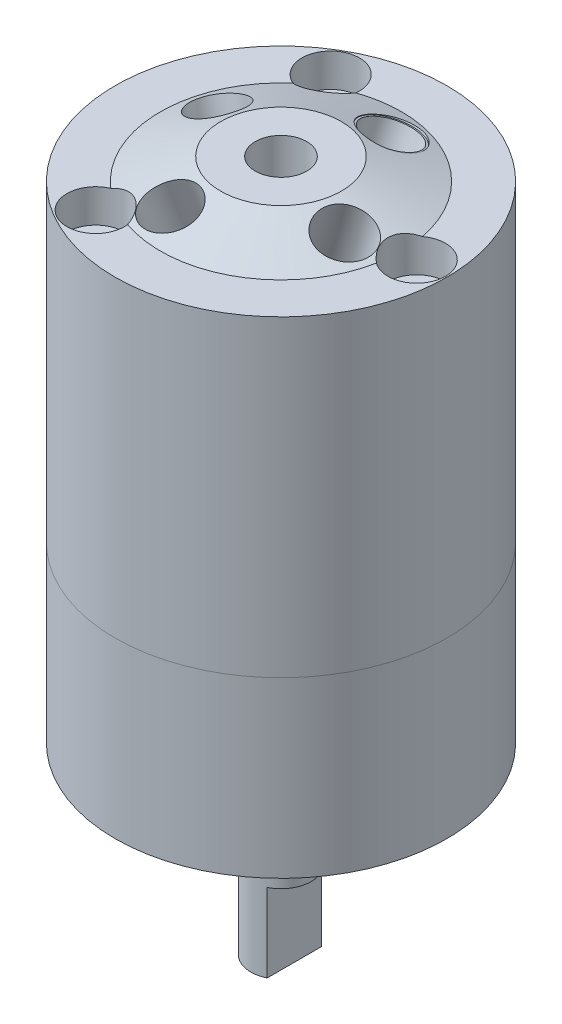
ISO-10303-21;
HEADER;
FILE_DESCRIPTION(('STEP AP214'),'2;1');
FILE_NAME('part.step','',(''),(''),'','','');
FILE_SCHEMA(('AUTOMOTIVE_DESIGN { 1 0 10303 214 1 1 1 1 }'));
ENDSEC;
DATA;
#1=APPLICATION_CONTEXT('core data for automotive mechanical design processes');
#2=APPLICATION_PROTOCOL_DEFINITION('international standard','automotive_design',2000,#1);
#3=PRODUCT_CONTEXT('',#1,'mechanical');
#4=PRODUCT('Part','Part','',(#3));
#5=PRODUCT_RELATED_PRODUCT_CATEGORY('part','',(#4));
#6=PRODUCT_DEFINITION_FORMATION('','',#4);
#7=PRODUCT_DEFINITION_CONTEXT('part definition',#1,'design');
#8=PRODUCT_DEFINITION('design','',#6,#7);
#9=PRODUCT_DEFINITION_SHAPE('','',#8);
#10=(LENGTH_UNIT() NAMED_UNIT(*) SI_UNIT(.MILLI.,.METRE.));
#11=(NAMED_UNIT(*) PLANE_ANGLE_UNIT() SI_UNIT($,.RADIAN.));
#12=(NAMED_UNIT(*) SI_UNIT($,.STERADIAN.) SOLID_ANGLE_UNIT());
#13=UNCERTAINTY_MEASURE_WITH_UNIT(LENGTH_MEASURE(1.E-05),#10,'distance_accuracy_value','');
#14=(GEOMETRIC_REPRESENTATION_CONTEXT(3) GLOBAL_UNCERTAINTY_ASSIGNED_CONTEXT((#13)) GLOBAL_UNIT_ASSIGNED_CONTEXT((#10,
#11,#12)) REPRESENTATION_CONTEXT('',''));
#15=CARTESIAN_POINT('',(0.,0.,0.));
#16=DIRECTION('',(0.,0.,1.));
#17=DIRECTION('',(1.,0.,0.));
#18=AXIS2_PLACEMENT_3D('',#15,#16,#17);
#19=CARTESIAN_POINT('',(0.,-19.304,0.));
#20=DIRECTION('',(0.,1.,0.));
#21=DIRECTION('',(0.,0.,1.));
#22=AXIS2_PLACEMENT_3D('',#19,#20,#21);
#23=CYLINDRICAL_SURFACE('',#22,3.175);
#24=CARTESIAN_POINT('',(0.,-19.304,0.));
#25=DIRECTION('',(0.,-1.,0.));
#26=DIRECTION('',(0.,0.,-1.));
#27=AXIS2_PLACEMENT_3D('',#24,#25,#26);
#28=CIRCLE('',#27,3.175);
#29=CARTESIAN_POINT('',(1.397,-19.304,2.85114292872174));
#30=VERTEX_POINT('',#29);
#31=CARTESIAN_POINT('',(1.397,-19.304,-2.85114292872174));
#32=VERTEX_POINT('',#31);
#33=EDGE_CURVE('E80',#30,#32,#28,.T.);
#34=ORIENTED_EDGE('',*,*,#33,.F.);
#35=DIRECTION('',(0.,1.,0.));
#36=VECTOR('',#35,1.);
#37=CARTESIAN_POINT('',(1.397,-19.304,2.85114292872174));
#38=LINE('',#37,#36);
#39=CARTESIAN_POINT('',(1.397,-11.049,2.85114292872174));
#40=VERTEX_POINT('',#39);
#41=EDGE_CURVE('E59',#30,#40,#38,.T.);
#42=ORIENTED_EDGE('',*,*,#41,.T.);
#43=CARTESIAN_POINT('',(0.,-11.049,0.));
#44=DIRECTION('',(0.,1.,0.));
#45=DIRECTION('',(0.,0.,1.));
#46=AXIS2_PLACEMENT_3D('',#43,#44,#45);
#47=CIRCLE('',#46,3.175);
#48=CARTESIAN_POINT('',(1.397,-11.049,-2.85114292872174));
#49=VERTEX_POINT('',#48);
#50=EDGE_CURVE('E12',#40,#49,#47,.T.);
#51=ORIENTED_EDGE('',*,*,#50,.T.);
#52=DIRECTION('',(0.,1.,0.));
#53=VECTOR('',#52,1.);
#54=CARTESIAN_POINT('',(1.397,-19.304,-2.85114292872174));
#55=LINE('',#54,#53);
#56=EDGE_CURVE('E68',#49,#32,#55,.F.);
#57=ORIENTED_EDGE('',*,*,#56,.T.);
#58=EDGE_LOOP('',(#34,#42,#51,#57));
#59=FACE_BOUND('',#58,.T.);
#60=CARTESIAN_POINT('',(0.,0.,0.));
#61=DIRECTION('',(0.,-1.,0.));
#62=DIRECTION('',(0.,0.,-1.));
#63=AXIS2_PLACEMENT_3D('',#60,#61,#62);
#64=CIRCLE('',#63,3.175);
#65=CARTESIAN_POINT('',(0.,0.,-3.175));
#66=VERTEX_POINT('',#65);
#67=EDGE_CURVE('E81',#66,#66,#64,.T.);
#68=ORIENTED_EDGE('',*,*,#67,.T.);
#69=EDGE_LOOP('',(#68));
#70=FACE_BOUND('',#69,.T.);
#71=ADVANCED_FACE('F45',(#59,#70),#23,.T.);
#72=CARTESIAN_POINT('',(0.,-19.304,0.));
#73=DIRECTION('',(0.,-1.,0.));
#74=DIRECTION('',(0.,0.,-1.));
#75=AXIS2_PLACEMENT_3D('',#72,#73,#74);
#76=PLANE('',#75);
#77=DIRECTION('',(0.,0.,-1.));
#78=VECTOR('',#77,1.);
#79=CARTESIAN_POINT('',(1.397,-19.304,0.));
#80=LINE('',#79,#78);
#81=EDGE_CURVE('E52',#30,#32,#80,.T.);
#82=ORIENTED_EDGE('',*,*,#81,.F.);
#83=ORIENTED_EDGE('',*,*,#33,.T.);
#84=EDGE_LOOP('',(#82,#83));
#85=FACE_BOUND('',#84,.T.);
#86=ADVANCED_FACE('F87',(#85),#76,.T.);
#87=CARTESIAN_POINT('',(0.,0.,0.));
#88=DIRECTION('',(0.,-1.,0.));
#89=DIRECTION('',(0.,0.,-1.));
#90=AXIS2_PLACEMENT_3D('',#87,#88,#89);
#91=PLANE('',#90);
#92=ORIENTED_EDGE('',*,*,#67,.F.);
#93=EDGE_LOOP('',(#92));
#94=FACE_BOUND('',#93,.T.);
#95=ADVANCED_FACE('F89',(#94),#91,.F.);
#96=CARTESIAN_POINT('',(1.397,-11.049,-3.175));
#97=DIRECTION('',(0.,1.,0.));
#98=DIRECTION('',(0.,0.,1.));
#99=AXIS2_PLACEMENT_3D('',#96,#97,#98);
#100=PLANE('',#99);
#101=DIRECTION('',(0.,0.,1.));
#102=VECTOR('',#101,1.);
#103=CARTESIAN_POINT('',(1.397,-11.049,-3.175));
#104=LINE('',#103,#102);
#105=EDGE_CURVE('E71',#49,#40,#104,.T.);
#106=ORIENTED_EDGE('',*,*,#105,.F.);
#107=ORIENTED_EDGE('',*,*,#50,.F.);
#108=EDGE_LOOP('',(#106,#107));
#109=FACE_BOUND('',#108,.T.);
#110=ADVANCED_FACE('F77',(#109),#100,.F.);
#111=CARTESIAN_POINT('',(1.397,-11.049,-3.175));
#112=DIRECTION('',(-1.,0.,0.));
#113=DIRECTION('',(0.,-1.,0.));
#114=AXIS2_PLACEMENT_3D('',#111,#112,#113);
#115=PLANE('',#114);
#116=ORIENTED_EDGE('',*,*,#81,.T.);
#117=ORIENTED_EDGE('',*,*,#56,.F.);
#118=ORIENTED_EDGE('',*,*,#105,.T.);
#119=ORIENTED_EDGE('',*,*,#41,.F.);
#120=EDGE_LOOP('',(#116,#117,#118,#119));
#121=FACE_BOUND('',#120,.T.);
#122=ADVANCED_FACE('F70',(#121),#115,.F.);
#123=CLOSED_SHELL('',(#71,#86,#95,#110,#122));
#124=MANIFOLD_SOLID_BREP('B2_NOT_SHOWN',#123);
#125=CARTESIAN_POINT('',(0.,0.,0.));
#126=DIRECTION('',(0.,1.,0.));
#127=DIRECTION('',(0.,0.,1.));
#128=AXIS2_PLACEMENT_3D('',#125,#126,#127);
#129=CYLINDRICAL_SURFACE('',#128,4.7625);
#130=CARTESIAN_POINT('',(0.,0.,0.));
#131=DIRECTION('',(0.,-1.,0.));
#132=DIRECTION('',(0.,0.,-1.));
#133=AXIS2_PLACEMENT_3D('',#130,#131,#132);
#134=CIRCLE('',#133,4.7625);
#135=CARTESIAN_POINT('',(0.,0.,-4.7625));
#136=VERTEX_POINT('',#135);
#137=EDGE_CURVE('E44',#136,#136,#134,.T.);
#138=ORIENTED_EDGE('',*,*,#137,.F.);
#139=EDGE_LOOP('',(#138));
#140=FACE_BOUND('',#139,.T.);
#141=CARTESIAN_POINT('',(0.,6.35,0.));
#142=DIRECTION('',(0.,-1.,0.));
#143=DIRECTION('',(0.,0.,-1.));
#144=AXIS2_PLACEMENT_3D('',#141,#142,#143);
#145=CIRCLE('',#144,4.7625);
#146=CARTESIAN_POINT('',(0.,6.35,-4.7625));
#147=VERTEX_POINT('',#146);
#148=EDGE_CURVE('E144',#147,#147,#145,.T.);
#149=ORIENTED_EDGE('',*,*,#148,.T.);
#150=EDGE_LOOP('',(#149));
#151=FACE_BOUND('',#150,.T.);
#152=ADVANCED_FACE('F141',(#140,#151),#129,.T.);
#153=CARTESIAN_POINT('',(0.,0.,0.));
#154=DIRECTION('',(0.,-1.,0.));
#155=DIRECTION('',(0.,0.,-1.));
#156=AXIS2_PLACEMENT_3D('',#153,#154,#155);
#157=PLANE('',#156);
#158=ORIENTED_EDGE('',*,*,#137,.T.);
#159=EDGE_LOOP('',(#158));
#160=FACE_BOUND('',#159,.T.);
#161=ADVANCED_FACE('F156',(#160),#157,.T.);
#162=CARTESIAN_POINT('',(0.,6.35,0.));
#163=DIRECTION('',(0.,-1.,0.));
#164=DIRECTION('',(0.,0.,-1.));
#165=AXIS2_PLACEMENT_3D('',#162,#163,#164);
#166=PLANE('',#165);
#167=ORIENTED_EDGE('',*,*,#148,.F.);
#168=EDGE_LOOP('',(#167));
#169=FACE_BOUND('',#168,.T.);
#170=ADVANCED_FACE('F154',(#169),#166,.F.);
#171=CLOSED_SHELL('',(#152,#161,#170));
#172=MANIFOLD_SOLID_BREP('B6_NOT_SHOWN',#171);
#173=CARTESIAN_POINT('',(0.,25.527,0.));
#174=DIRECTION('',(0.,1.,0.));
#175=DIRECTION('',(0.,0.,1.));
#176=AXIS2_PLACEMENT_3D('',#173,#174,#175);
#177=CYLINDRICAL_SURFACE('',#176,0.508);
#178=CARTESIAN_POINT('',(0.,45.847,0.));
#179=DIRECTION('',(0.,1.,0.));
#180=DIRECTION('',(0.,0.,1.));
#181=AXIS2_PLACEMENT_3D('',#178,#179,#180);
#182=CIRCLE('',#181,0.508);
#183=CARTESIAN_POINT('',(0.,45.847,0.508));
#184=VERTEX_POINT('',#183);
#185=EDGE_CURVE('E805',#184,#184,#182,.T.);
#186=ORIENTED_EDGE('',*,*,#185,.T.);
#187=EDGE_LOOP('',(#186));
#188=FACE_BOUND('',#187,.T.);
#189=CARTESIAN_POINT('',(0.,25.8656666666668,0.));
#190=DIRECTION('',(0.254965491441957,0.171919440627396,-0.951544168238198));
#191=DIRECTION('',(-0.04449602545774,0.985111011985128,0.166061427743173));
#192=AXIS2_PLACEMENT_3D('',#189,#190,#191);
#193=ELLIPSE('',#192,2.95487234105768,0.508);
#194=CARTESIAN_POINT('',(0.254000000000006,27.9239677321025,0.439940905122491));
#195=VERTEX_POINT('',#194);
#196=CARTESIAN_POINT('',(-0.439940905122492,27.9239677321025,0.254000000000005));
#197=VERTEX_POINT('',#196);
#198=EDGE_CURVE('E525',#195,#197,#193,.F.);
#199=ORIENTED_EDGE('',*,*,#198,.T.);
#200=CARTESIAN_POINT('',(0.,25.8656666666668,0.));
#201=DIRECTION('',(0.951544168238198,0.171919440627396,0.25496549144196));
#202=DIRECTION('',(-0.166061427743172,0.985111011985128,-0.0444960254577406));
#203=AXIS2_PLACEMENT_3D('',#200,#201,#202);
#204=ELLIPSE('',#203,2.95487234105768,0.508);
#205=CARTESIAN_POINT('',(-0.254000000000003,27.9239677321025,-0.439940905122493));
#206=VERTEX_POINT('',#205);
#207=EDGE_CURVE('E530',#197,#206,#204,.F.);
#208=ORIENTED_EDGE('',*,*,#207,.T.);
#209=CARTESIAN_POINT('',(0.,25.8656666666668,0.));
#210=DIRECTION('',(-0.254965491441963,0.171919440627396,0.951544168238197));
#211=DIRECTION('',(0.0444960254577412,0.985111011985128,-0.166061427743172));
#212=AXIS2_PLACEMENT_3D('',#209,#210,#211);
#213=ELLIPSE('',#212,2.95487234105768,0.508);
#214=CARTESIAN_POINT('',(0.439940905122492,27.9239677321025,-0.254000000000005));
#215=VERTEX_POINT('',#214);
#216=EDGE_CURVE('E792',#206,#215,#213,.F.);
#217=ORIENTED_EDGE('',*,*,#216,.T.);
#218=CARTESIAN_POINT('',(0.,25.8656666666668,0.));
#219=DIRECTION('',(-0.951544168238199,0.171919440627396,-0.254965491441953));
#220=DIRECTION('',(0.166061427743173,0.985111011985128,0.0444960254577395));
#221=AXIS2_PLACEMENT_3D('',#218,#219,#220);
#222=ELLIPSE('',#221,2.95487234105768,0.508);
#223=EDGE_CURVE('E519',#215,#195,#222,.F.);
#224=ORIENTED_EDGE('',*,*,#223,.T.);
#225=EDGE_LOOP('',(#199,#208,#217,#224));
#226=FACE_BOUND('',#225,.T.);
#227=ADVANCED_FACE('F190',(#188,#226),#177,.F.);
#228=CARTESIAN_POINT('',(0.,53.467,0.));
#229=DIRECTION('',(0.,-1.,0.));
#230=DIRECTION('',(0.,0.,-1.));
#231=AXIS2_PLACEMENT_3D('',#228,#229,#230);
#232=CONICAL_SURFACE('',#231,6.35,1.22524074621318);
#233=CARTESIAN_POINT('',(7.54989955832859,53.0304006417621,0.441131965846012));
#234=CARTESIAN_POINT('',(7.65768452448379,52.9937832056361,0.340259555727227));
#235=CARTESIAN_POINT('',(7.77320726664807,52.9533701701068,0.248879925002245));
#236=CARTESIAN_POINT('',(8.0167749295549,52.8669438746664,0.0878426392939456));
#237=CARTESIAN_POINT('',(8.14483356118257,52.8209244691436,0.0182091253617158));
#238=CARTESIAN_POINT('',(8.41000839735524,52.7252646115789,-0.0971837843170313));
#239=CARTESIAN_POINT('',(8.54712225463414,52.6756250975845,-0.142949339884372));
#240=CARTESIAN_POINT('',(8.82664005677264,52.5745355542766,-0.20923527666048));
#241=CARTESIAN_POINT('',(8.96904263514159,52.5230859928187,-0.229762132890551));
#242=CARTESIAN_POINT('',(9.25465979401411,52.4201557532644,-0.244939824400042));
#243=CARTESIAN_POINT('',(9.39786995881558,52.3686757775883,-0.239678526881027));
#244=CARTESIAN_POINT('',(9.68147689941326,52.266905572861,-0.203627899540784));
#245=CARTESIAN_POINT('',(9.82187358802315,52.2166153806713,-0.172837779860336));
#246=CARTESIAN_POINT('',(10.0955104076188,52.1185175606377,-0.0867199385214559));
#247=CARTESIAN_POINT('',(10.228763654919,52.0707053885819,-0.0314390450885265));
#248=CARTESIAN_POINT('',(10.4845316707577,51.9784649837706,0.102036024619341));
#249=CARTESIAN_POINT('',(10.6070463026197,51.9340367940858,0.180230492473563));
#250=CARTESIAN_POINT('',(10.8380996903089,51.8492837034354,0.357534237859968));
#251=CARTESIAN_POINT('',(10.9465974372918,51.808970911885,0.456702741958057));
#252=CARTESIAN_POINT('',(11.14601659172,51.7332971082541,0.672979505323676));
#253=CARTESIAN_POINT('',(11.2369377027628,51.6979361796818,0.790088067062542));
#254=CARTESIAN_POINT('',(11.3987506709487,51.632646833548,1.03928941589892));
#255=CARTESIAN_POINT('',(11.469582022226,51.6027349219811,1.17142582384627));
#256=CARTESIAN_POINT('',(11.5887107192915,51.5489448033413,1.44663357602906));
#257=CARTESIAN_POINT('',(11.6370080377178,51.5250666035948,1.58970493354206));
#258=CARTESIAN_POINT('',(11.7095636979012,51.4837146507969,1.88267044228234));
#259=CARTESIAN_POINT('',(11.7338276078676,51.4662394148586,2.03256300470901));
#260=CARTESIAN_POINT('',(11.7575407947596,51.4379504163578,2.33491757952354));
#261=CARTESIAN_POINT('',(11.756990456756,51.4271365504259,2.48737955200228));
#262=CARTESIAN_POINT('',(11.7310549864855,51.4123513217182,2.79012888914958));
#263=CARTESIAN_POINT('',(11.7057316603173,51.4083629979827,2.94042072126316));
#264=CARTESIAN_POINT('',(11.6310366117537,51.4072361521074,3.23493032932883));
#265=CARTESIAN_POINT('',(11.5816651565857,51.4100975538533,3.37914817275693));
#266=CARTESIAN_POINT('',(11.4603940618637,51.4226173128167,3.65719131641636));
#267=CARTESIAN_POINT('',(11.388529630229,51.4322650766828,3.79103245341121));
#268=CARTESIAN_POINT('',(11.2243446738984,51.4582019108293,4.04479997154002));
#269=CARTESIAN_POINT('',(11.1320240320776,51.474491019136,4.16472627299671));
#270=CARTESIAN_POINT('',(10.9295068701,51.5134894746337,4.38744289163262));
#271=CARTESIAN_POINT('',(10.8192893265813,51.5362063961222,4.49021276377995));
#272=CARTESIAN_POINT('',(10.5842796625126,51.5877077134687,4.67559084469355));
#273=CARTESIAN_POINT('',(10.4594872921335,51.6164922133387,4.75819870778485));
#274=CARTESIAN_POINT('',(10.1986330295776,51.679762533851,4.9011570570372));
#275=CARTESIAN_POINT('',(10.0625431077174,51.7142627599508,4.96145002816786));
#276=CARTESIAN_POINT('',(9.78335218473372,51.7883512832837,5.057816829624));
#277=CARTESIAN_POINT('',(9.64025112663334,51.8279396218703,5.09389046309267));
#278=CARTESIAN_POINT('',(9.35111698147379,51.9115509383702,5.14084281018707));
#279=CARTESIAN_POINT('',(9.20508177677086,51.9555772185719,5.15170261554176));
#280=CARTESIAN_POINT('',(8.9144755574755,52.0472098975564,5.14787800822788));
#281=CARTESIAN_POINT('',(8.7699045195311,52.0948162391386,5.13319400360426));
#282=CARTESIAN_POINT('',(8.48685013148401,52.1924874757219,5.07878332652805));
#283=CARTESIAN_POINT('',(8.34835191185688,52.242545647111,5.03912195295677));
#284=CARTESIAN_POINT('',(8.08109143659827,52.3440626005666,4.93596032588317));
#285=CARTESIAN_POINT('',(7.95232891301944,52.3955213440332,4.87246072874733));
#286=CARTESIAN_POINT('',(7.7086487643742,52.4983021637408,4.723696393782));
#287=CARTESIAN_POINT('',(7.59368775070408,52.5496241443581,4.63850264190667));
#288=CARTESIAN_POINT('',(7.38033656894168,52.6507390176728,4.44867881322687));
#289=CARTESIAN_POINT('',(7.28194650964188,52.7005319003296,4.34404860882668));
#290=CARTESIAN_POINT('',(7.10426916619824,52.7968919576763,4.11817515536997));
#291=CARTESIAN_POINT('',(7.02500218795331,52.8434556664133,3.99691445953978));
#292=CARTESIAN_POINT('',(6.88768228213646,52.9314006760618,3.74121371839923));
#293=CARTESIAN_POINT('',(6.82963039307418,52.9727817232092,3.60677302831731));
#294=CARTESIAN_POINT('',(6.73583453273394,53.0485771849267,3.32769624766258));
#295=CARTESIAN_POINT('',(6.70020020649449,53.0829568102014,3.18301383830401));
#296=CARTESIAN_POINT('',(6.65237989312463,53.1425822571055,2.88800542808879));
#297=CARTESIAN_POINT('',(6.64019266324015,53.1678285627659,2.73767972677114));
#298=CARTESIAN_POINT('',(6.63934623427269,53.2075721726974,2.43569357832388));
#299=CARTESIAN_POINT('',(6.65066383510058,53.2220800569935,2.28403459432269));
#300=CARTESIAN_POINT('',(6.69630059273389,53.2393792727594,1.98350133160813));
#301=CARTESIAN_POINT('',(6.73062341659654,53.242168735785,1.83462750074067));
#302=CARTESIAN_POINT('',(6.82090365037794,53.2358511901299,1.54506873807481));
#303=CARTESIAN_POINT('',(6.87670140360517,53.2268308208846,1.40433198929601));
#304=CARTESIAN_POINT('',(7.00843427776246,53.1976815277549,1.13399531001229));
#305=CARTESIAN_POINT('',(7.08434820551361,53.1775642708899,1.00438384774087));
#306=CARTESIAN_POINT('',(7.22529574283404,53.1361198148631,0.801673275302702));
#307=CARTESIAN_POINT('',(7.28520714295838,53.117546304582,0.724378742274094));
#308=CARTESIAN_POINT('',(7.41227650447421,53.0766561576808,0.577081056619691));
#309=CARTESIAN_POINT('',(7.47943448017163,53.0543395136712,0.507077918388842));
#310=CARTESIAN_POINT('',(7.54989955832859,53.0304006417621,0.441131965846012));
#311=B_SPLINE_CURVE_WITH_KNOTS('',3,(#233,#234,#235,#236,#237,#238,#239,#240,#241,#242,#243,
#244,#245,#246,#247,#248,#249,#250,#251,#252,#253,#254,#255,#256,#257,#258,#259,#260,#261,#262,
#263,#264,#265,#266,#267,#268,#269,#270,#271,#272,#273,#274,#275,#276,#277,#278,#279,#280,#281,
#282,#283,#284,#285,#286,#287,#288,#289,#290,#291,#292,#293,#294,#295,#296,#297,#298,#299,#300,
#301,#302,#303,#304,#305,#306,#307,#308,#309,#310),.UNSPECIFIED.,.T.,.F.,(4,2,2,2,2,2,2,2,2,2,2,
2,2,2,2,2,2,2,2,2,2,2,2,2,2,2,2,2,2,2,2,2,2,2,2,2,2,2,4),(0.,0.455932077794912,
0.912368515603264,1.36868709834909,1.82488858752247,2.27953675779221,2.73419899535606,
3.18799561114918,3.64179800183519,4.09689937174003,4.55200841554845,5.00847393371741,
5.46494000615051,5.92130029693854,6.3776535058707,6.83287105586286,7.28808354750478,
7.74258703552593,8.19709312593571,8.65213703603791,9.10718874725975,9.56340528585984,
10.0196255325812,10.4761877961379,10.9327427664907,11.3881090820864,11.8434628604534,
12.2973453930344,12.7512309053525,13.2055962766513,13.6599838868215,14.1165769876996,
14.5731458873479,15.0292643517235,15.4854555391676,15.9383186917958,16.3907066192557,
16.6887744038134,16.9868427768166),.UNSPECIFIED.);
#312=CARTESIAN_POINT('',(7.54989955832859,53.0304006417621,0.441131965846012));
#313=VERTEX_POINT('',#312);
#314=EDGE_CURVE('E561',#313,#313,#311,.T.);
#315=ORIENTED_EDGE('',*,*,#314,.T.);
#316=EDGE_LOOP('',(#315));
#317=FACE_BOUND('',#316,.T.);
#318=CARTESIAN_POINT('',(-4.59946783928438,52.5697028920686,7.55212286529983));
#319=CARTESIAN_POINT('',(-4.50816924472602,52.6207171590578,7.44181278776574));
#320=CARTESIAN_POINT('',(-4.40675510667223,52.6711594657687,7.33946876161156));
#321=CARTESIAN_POINT('',(-4.1865874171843,52.7691397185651,7.15359709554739));
#322=CARTESIAN_POINT('',(-4.06781407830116,52.8166742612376,7.07009120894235));
#323=CARTESIAN_POINT('',(-3.81638296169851,52.9068703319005,6.92417061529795));
#324=CARTESIAN_POINT('',(-3.68373398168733,52.9495349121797,6.86174264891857));
#325=CARTESIAN_POINT('',(-3.4081706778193,53.0280292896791,6.75938628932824));
#326=CARTESIAN_POINT('',(-3.26525847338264,53.0638604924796,6.71945326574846));
#327=CARTESIAN_POINT('',(-2.97265320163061,53.1268508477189,6.66279429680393));
#328=CARTESIAN_POINT('',(-2.82294340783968,53.1539871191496,6.64612920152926));
#329=CARTESIAN_POINT('',(-2.52123738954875,53.197774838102,6.63640104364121));
#330=CARTESIAN_POINT('',(-2.36924122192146,53.2144265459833,6.64333739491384));
#331=CARTESIAN_POINT('',(-2.06800590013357,53.236048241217,6.68033384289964));
#332=CARTESIAN_POINT('',(-1.91875686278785,53.2410752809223,6.71028004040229));
#333=CARTESIAN_POINT('',(-1.62652537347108,53.2392540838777,6.79224017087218));
#334=CARTESIAN_POINT('',(-1.48354274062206,53.2324061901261,6.84425346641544));
#335=CARTESIAN_POINT('',(-1.20876101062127,53.2073987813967,6.96857341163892));
#336=CARTESIAN_POINT('',(-1.07690225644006,53.1893046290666,7.04076148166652));
#337=CARTESIAN_POINT('',(-0.827181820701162,53.143065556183,7.20373495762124));
#338=CARTESIAN_POINT('',(-0.709320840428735,53.114920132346,7.2945212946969));
#339=CARTESIAN_POINT('',(-0.490273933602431,53.0500669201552,7.49304894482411));
#340=CARTESIAN_POINT('',(-0.389190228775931,53.0133097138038,7.60088689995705));
#341=CARTESIAN_POINT('',(-0.207429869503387,52.9332606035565,7.83044410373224));
#342=CARTESIAN_POINT('',(-0.126753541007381,52.8899685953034,7.95216357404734));
#343=CARTESIAN_POINT('',(0.0121900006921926,52.7985932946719,8.20698063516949));
#344=CARTESIAN_POINT('',(0.0703478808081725,52.7504880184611,8.3401299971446));
#345=CARTESIAN_POINT('',(0.161964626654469,52.6515545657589,8.61371569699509));
#346=CARTESIAN_POINT('',(0.195424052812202,52.6007264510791,8.7541518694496));
#347=CARTESIAN_POINT('',(0.236549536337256,52.4982649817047,9.03785096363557));
#348=CARTESIAN_POINT('',(0.244313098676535,52.4466354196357,9.18110111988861));
#349=CARTESIAN_POINT('',(0.234076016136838,52.3438893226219,9.46686160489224));
#350=CARTESIAN_POINT('',(0.216075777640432,52.2927727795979,9.60937194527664));
#351=CARTESIAN_POINT('',(0.154940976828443,52.1925155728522,9.8890753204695));
#352=CARTESIAN_POINT('',(0.111887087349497,52.1433691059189,10.0262839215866));
#353=CARTESIAN_POINT('',(0.00197068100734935,52.0479741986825,10.2918878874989));
#354=CARTESIAN_POINT('',(-0.0648920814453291,52.0017257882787,10.4202831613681));
#355=CARTESIAN_POINT('',(-0.220643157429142,51.9129595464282,10.664768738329));
#356=CARTESIAN_POINT('',(-0.3095750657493,51.87044932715,10.7808340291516));
#357=CARTESIAN_POINT('',(-0.506840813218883,51.7900338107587,10.9969706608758));
#358=CARTESIAN_POINT('',(-0.615175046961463,51.752128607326,11.0970416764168));
#359=CARTESIAN_POINT('',(-0.848561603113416,51.6814399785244,11.2785536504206));
#360=CARTESIAN_POINT('',(-0.973669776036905,51.6486744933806,11.3599297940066));
#361=CARTESIAN_POINT('',(-1.23675238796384,51.5889473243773,11.5011739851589));
#362=CARTESIAN_POINT('',(-1.37472689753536,51.5619856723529,11.5610419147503));
#363=CARTESIAN_POINT('',(-1.6597090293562,51.5142680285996,11.657473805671));
#364=CARTESIAN_POINT('',(-1.8067224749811,51.4935160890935,11.6940225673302));
#365=CARTESIAN_POINT('',(-2.10550252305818,51.4585577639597,11.7425972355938));
#366=CARTESIAN_POINT('',(-2.25726906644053,51.4443512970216,11.7546234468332));
#367=CARTESIAN_POINT('',(-2.56087630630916,51.4227219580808,11.7537236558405));
#368=CARTESIAN_POINT('',(-2.71271610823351,51.415284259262,11.7408523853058));
#369=CARTESIAN_POINT('',(-3.01246520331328,51.4072505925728,11.6905843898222));
#370=CARTESIAN_POINT('',(-3.16037455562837,51.4066545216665,11.6531880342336));
#371=CARTESIAN_POINT('',(-3.44774515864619,51.4123068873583,11.5550354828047));
#372=CARTESIAN_POINT('',(-3.58722327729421,51.4185411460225,11.4943278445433));
#373=CARTESIAN_POINT('',(-3.85411926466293,51.4377384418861,11.3513108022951));
#374=CARTESIAN_POINT('',(-3.98153709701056,51.4507014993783,11.2690013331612));
#375=CARTESIAN_POINT('',(-4.22079231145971,51.4831704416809,11.085142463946));
#376=CARTESIAN_POINT('',(-4.33262198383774,51.5026795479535,10.9835836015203));
#377=CARTESIAN_POINT('',(-4.53751189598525,51.547945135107,10.764223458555));
#378=CARTESIAN_POINT('',(-4.63057181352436,51.5737017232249,10.6464218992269));
#379=CARTESIAN_POINT('',(-4.79555618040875,51.6311399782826,10.3977014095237));
#380=CARTESIAN_POINT('',(-4.86742702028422,51.6628363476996,10.2667503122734));
#381=CARTESIAN_POINT('',(-4.98773275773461,51.731607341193,9.99581110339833));
#382=CARTESIAN_POINT('',(-5.03616817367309,51.7686818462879,9.85582319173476));
#383=CARTESIAN_POINT('',(-5.10832363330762,51.847645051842,9.57069893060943));
#384=CARTESIAN_POINT('',(-5.13200931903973,51.8895403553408,9.42555571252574));
#385=CARTESIAN_POINT('',(-5.15389470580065,51.9773604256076,9.13452773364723));
#386=CARTESIAN_POINT('',(-5.15208889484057,52.023286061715,8.98864281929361));
#387=CARTESIAN_POINT('',(-5.12307102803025,52.1181772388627,8.7006713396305));
#388=CARTESIAN_POINT('',(-5.09589434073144,52.1671384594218,8.55857976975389));
#389=CARTESIAN_POINT('',(-5.01698031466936,52.2670463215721,8.28225743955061));
#390=CARTESIAN_POINT('',(-4.96527093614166,52.3179906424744,8.14801792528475));
#391=CARTESIAN_POINT('',(-4.86099428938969,52.4026409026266,7.93616462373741));
#392=CARTESIAN_POINT('',(-4.81503532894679,52.4361526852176,7.85514965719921));
#393=CARTESIAN_POINT('',(-4.71396695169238,52.5030912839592,7.69900716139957));
#394=CARTESIAN_POINT('',(-4.65885759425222,52.5365181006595,7.62387959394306));
#395=CARTESIAN_POINT('',(-4.59946783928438,52.5697028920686,7.55212286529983));
#396=B_SPLINE_CURVE_WITH_KNOTS('',3,(#318,#319,#320,#321,#322,#323,#324,#325,#326,#327,#328,
#329,#330,#331,#332,#333,#334,#335,#336,#337,#338,#339,#340,#341,#342,#343,#344,#345,#346,#347,
#348,#349,#350,#351,#352,#353,#354,#355,#356,#357,#358,#359,#360,#361,#362,#363,#364,#365,#366,
#367,#368,#369,#370,#371,#372,#373,#374,#375,#376,#377,#378,#379,#380,#381,#382,#383,#384,#385,
#386,#387,#388,#389,#390,#391,#392,#393,#394,#395),.UNSPECIFIED.,.T.,.F.,(4,2,2,2,2,2,2,2,2,2,2,
2,2,2,2,2,2,2,2,2,2,2,2,2,2,2,2,2,2,2,2,2,2,2,2,2,2,2,4),(0.,0.455659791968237,
0.911843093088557,1.36773888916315,1.82354080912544,2.28053251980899,2.73751288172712,
3.19224563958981,3.64696526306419,4.09906647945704,4.55119033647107,5.00597512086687,
5.46076716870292,5.91774046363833,6.37470338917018,6.82993033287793,7.28515009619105,
7.73891209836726,8.19267878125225,8.64734905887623,9.10202858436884,9.55826145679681,
10.0144968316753,10.4710292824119,10.9275560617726,11.3830804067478,11.8385978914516,
12.2931716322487,12.7477467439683,13.202545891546,13.6573528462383,14.1133008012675,
14.5692386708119,15.0258086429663,15.4824773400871,15.9385103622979,16.3940248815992,
16.6904335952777,16.9868403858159),.UNSPECIFIED.);
#397=CARTESIAN_POINT('',(-4.59946783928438,52.5697028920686,7.55212286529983));
#398=VERTEX_POINT('',#397);
#399=EDGE_CURVE('E1035',#398,#398,#396,.T.);
#400=ORIENTED_EDGE('',*,*,#399,.T.);
#401=EDGE_LOOP('',(#400));
#402=FACE_BOUND('',#401,.T.);
#403=CARTESIAN_POINT('',(-11.1235991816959,51.4765506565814,-4.16854877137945));
#404=CARTESIAN_POINT('',(-11.0278236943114,51.4940690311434,-4.28544332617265));
#405=CARTESIAN_POINT('',(-10.9225969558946,51.5148612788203,-4.39423647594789));
#406=CARTESIAN_POINT('',(-10.6963488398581,51.562680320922,-4.59247194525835));
#407=CARTESIAN_POINT('',(-10.575309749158,51.589714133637,-4.68189226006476));
#408=CARTESIAN_POINT('',(-10.3211128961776,51.6495753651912,-4.83875796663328));
#409=CARTESIAN_POINT('',(-10.1879613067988,51.6823998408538,-4.90621447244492));
#410=CARTESIAN_POINT('',(-9.91342639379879,51.7533155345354,-5.01732339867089));
#411=CARTESIAN_POINT('',(-9.77204494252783,51.7914055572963,-5.06098121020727));
#412=CARTESIAN_POINT('',(-9.48503263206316,51.8722481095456,-5.12334439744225));
#413=CARTESIAN_POINT('',(-9.33939825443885,51.9150045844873,-5.1420284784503));
#414=CARTESIAN_POINT('',(-9.0482678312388,52.0043712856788,-5.15386166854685));
#415=CARTESIAN_POINT('',(-8.90277178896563,52.0509816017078,-5.1470101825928));
#416=CARTESIAN_POINT('',(-8.61651537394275,52.1470089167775,-5.10802012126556));
#417=CARTESIAN_POINT('',(-8.47574541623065,52.1964196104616,-5.07593641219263));
#418=CARTESIAN_POINT('',(-8.20273598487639,52.297024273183,-4.98747578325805));
#419=CARTESIAN_POINT('',(-8.07049626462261,52.3482181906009,-4.93109956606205));
#420=CARTESIAN_POINT('',(-7.81882246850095,52.4509003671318,-4.79591844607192));
#421=CARTESIAN_POINT('',(-7.69934560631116,52.5023869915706,-4.7171919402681));
#422=CARTESIAN_POINT('',(-7.47604511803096,52.604330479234,-4.53948358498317));
#423=CARTESIAN_POINT('',(-7.37222142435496,52.654787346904,-4.44050182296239));
#424=CARTESIAN_POINT('',(-7.18302572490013,52.7529868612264,-4.22506138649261));
#425=CARTESIAN_POINT('',(-7.09765729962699,52.8007289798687,-4.10859932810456));
#426=CARTESIAN_POINT('',(-6.9475745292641,52.8916316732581,-3.86144491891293));
#427=CARTESIAN_POINT('',(-6.88286112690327,52.9347920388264,-3.73075191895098));
#428=CARTESIAN_POINT('',(-6.77535584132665,53.0147630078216,-3.45806154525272));
#429=CARTESIAN_POINT('',(-6.73266890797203,53.0515426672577,-3.31601370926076));
#430=CARTESIAN_POINT('',(-6.67056433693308,53.1165472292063,-3.02503723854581));
#431=CARTESIAN_POINT('',(-6.6511466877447,53.1447721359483,-2.87610860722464));
#432=CARTESIAN_POINT('',(-6.63584189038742,53.1909614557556,-2.57537765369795));
#433=CARTESIAN_POINT('',(-6.63996891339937,53.2089196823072,-2.42357365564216));
#434=CARTESIAN_POINT('',(-6.6714707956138,53.2333274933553,-2.12146409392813));
#435=CARTESIAN_POINT('',(-6.69884398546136,53.2397779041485,-1.97115842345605));
#436=CARTESIAN_POINT('',(-6.77567389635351,53.2407041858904,-1.6774855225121));
#437=CARTESIAN_POINT('',(-6.82496160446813,53.2352704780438,-1.53407432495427));
#438=CARTESIAN_POINT('',(-6.94423416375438,53.2130010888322,-1.2570815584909));
#439=CARTESIAN_POINT('',(-7.01421946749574,53.1961651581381,-1.12350020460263));
#440=CARTESIAN_POINT('',(-7.17304864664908,53.1522411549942,-0.870064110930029));
#441=CARTESIAN_POINT('',(-7.26187970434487,53.1251600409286,-0.750200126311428));
#442=CARTESIAN_POINT('',(-7.45624367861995,53.0623885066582,-0.527471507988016));
#443=CARTESIAN_POINT('',(-7.56177732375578,53.0266977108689,-0.424607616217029));
#444=CARTESIAN_POINT('',(-7.78781879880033,52.9483003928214,-0.238071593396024));
#445=CARTESIAN_POINT('',(-7.9084357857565,52.9055419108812,-0.154553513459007));
#446=CARTESIAN_POINT('',(-8.16089567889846,52.8151948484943,-0.0101653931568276));
#447=CARTESIAN_POINT('',(-8.29273851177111,52.7676062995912,0.0507047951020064));
#448=CARTESIAN_POINT('',(-8.56420126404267,52.6694737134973,0.148017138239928));
#449=CARTESIAN_POINT('',(-8.70382495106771,52.6189282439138,0.184447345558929));
#450=CARTESIAN_POINT('',(-8.98691328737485,52.5166439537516,0.231726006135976));
#451=CARTESIAN_POINT('',(-9.13037784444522,52.4649051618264,0.242575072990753));
#452=CARTESIAN_POINT('',(-9.41636307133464,52.3620236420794,0.238364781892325));
#453=CARTESIAN_POINT('',(-9.55888497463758,52.310879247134,0.22342904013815));
#454=CARTESIAN_POINT('',(-9.83956918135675,52.2102533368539,0.168323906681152));
#455=CARTESIAN_POINT('',(-9.97773150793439,52.1607718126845,0.128154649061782));
#456=CARTESIAN_POINT('',(-10.2455705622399,52.064633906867,0.0238077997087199));
#457=CARTESIAN_POINT('',(-10.3752542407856,52.017975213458,-0.0403498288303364));
#458=CARTESIAN_POINT('',(-10.6224909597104,51.9283784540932,-0.190813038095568));
#459=CARTESIAN_POINT('',(-10.7400437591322,51.8854404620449,-0.277119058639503));
#460=CARTESIAN_POINT('',(-10.9599503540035,51.8039363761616,-0.469719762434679));
#461=CARTESIAN_POINT('',(-11.0622529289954,51.7653851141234,-0.576079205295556));
#462=CARTESIAN_POINT('',(-11.2481780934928,51.6934732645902,-0.805560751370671));
#463=CARTESIAN_POINT('',(-11.3318003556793,51.6601127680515,-0.928683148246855));
#464=CARTESIAN_POINT('',(-11.4780563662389,51.5990413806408,-1.18852122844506));
#465=CARTESIAN_POINT('',(-11.5406366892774,51.5713449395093,-1.32527038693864));
#466=CARTESIAN_POINT('',(-11.6426067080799,51.5221397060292,-1.60819844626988));
#467=CARTESIAN_POINT('',(-11.6819972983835,51.5006306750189,-1.7543769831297));
#468=CARTESIAN_POINT('',(-11.7363278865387,51.4641437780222,-2.05185465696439));
#469=CARTESIAN_POINT('',(-11.7512908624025,51.4491597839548,-2.20314884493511));
#470=CARTESIAN_POINT('',(-11.7563171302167,51.4259175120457,-2.50670211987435));
#471=CARTESIAN_POINT('',(-11.7463752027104,51.4176606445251,-2.65896140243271));
#472=CARTESIAN_POINT('',(-11.7018684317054,51.4080110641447,-2.95971506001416));
#473=CARTESIAN_POINT('',(-11.667355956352,51.4066038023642,-3.10821674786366));
#474=CARTESIAN_POINT('',(-11.5747534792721,51.4106382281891,-3.39745426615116));
#475=CARTESIAN_POINT('',(-11.51668966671,51.4160723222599,-3.53819852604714));
#476=CARTESIAN_POINT('',(-11.402630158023,51.4306339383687,-3.76130600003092));
#477=CARTESIAN_POINT('',(-11.3528512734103,51.4378366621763,-3.84703892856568));
#478=CARTESIAN_POINT('',(-11.2445899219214,51.4550783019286,-4.01251444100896));
#479=CARTESIAN_POINT('',(-11.1861074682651,51.4651172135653,-4.09225703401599));
#480=CARTESIAN_POINT('',(-11.1235991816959,51.4765506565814,-4.16854877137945));
#481=B_SPLINE_CURVE_WITH_KNOTS('',3,(#403,#404,#405,#406,#407,#408,#409,#410,#411,#412,#413,
#414,#415,#416,#417,#418,#419,#420,#421,#422,#423,#424,#425,#426,#427,#428,#429,#430,#431,#432,
#433,#434,#435,#436,#437,#438,#439,#440,#441,#442,#443,#444,#445,#446,#447,#448,#449,#450,#451,
#452,#453,#454,#455,#456,#457,#458,#459,#460,#461,#462,#463,#464,#465,#466,#467,#468,#469,#470,
#471,#472,#473,#474,#475,#476,#477,#478,#479,#480),.UNSPECIFIED.,.T.,.F.,(4,2,2,2,2,2,2,2,2,2,2,
2,2,2,2,2,2,2,2,2,2,2,2,2,2,2,2,2,2,2,2,2,2,2,2,2,2,2,4),(0.,0.456034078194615,
0.912583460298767,1.36890146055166,1.82511604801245,2.28171939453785,2.73833338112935,
3.19395721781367,3.64956787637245,4.10359974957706,4.55762966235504,5.01174758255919,
5.46588622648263,5.92216918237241,6.3784519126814,6.83500930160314,7.29153390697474,
7.74459710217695,8.19767020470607,8.6504361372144,9.10322182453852,9.55949779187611,
10.0157707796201,10.4722666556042,10.9287515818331,11.3830541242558,11.8373542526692,
12.2912771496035,12.7452090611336,13.2006327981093,13.6560645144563,14.1126439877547,
14.5692058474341,15.0253379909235,15.4815657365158,15.9368240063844,16.3915774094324,
16.6892104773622,16.9868430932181),.UNSPECIFIED.);
#482=CARTESIAN_POINT('',(-11.1235991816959,51.4765506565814,-4.16854877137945));
#483=VERTEX_POINT('',#482);
#484=EDGE_CURVE('E1028',#483,#483,#481,.T.);
#485=ORIENTED_EDGE('',*,*,#484,.T.);
#486=EDGE_LOOP('',(#485));
#487=FACE_BOUND('',#486,.T.);
#488=CARTESIAN_POINT('',(0.,53.467,0.));
#489=DIRECTION('',(0.,-1.,0.));
#490=DIRECTION('',(0.,0.,-1.));
#491=AXIS2_PLACEMENT_3D('',#488,#489,#490);
#492=CIRCLE('',#491,6.35);
#493=CARTESIAN_POINT('',(0.,53.467,-6.35));
#494=VERTEX_POINT('',#493);
#495=EDGE_CURVE('E820',#494,#494,#492,.T.);
#496=ORIENTED_EDGE('',*,*,#495,.T.);
#497=EDGE_LOOP('',(#496));
#498=FACE_BOUND('',#497,.T.);
#499=CARTESIAN_POINT('',(-8.32792610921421,51.1807999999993,-9.58904365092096));
#500=CARTESIAN_POINT('',(-8.25139075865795,51.2077441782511,-9.55637523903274));
#501=CARTESIAN_POINT('',(-8.17337775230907,51.2341421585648,-9.52680717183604));
#502=CARTESIAN_POINT('',(-8.01475359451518,51.2856170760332,-9.47411016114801));
#503=CARTESIAN_POINT('',(-7.93414158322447,51.3106935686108,-9.45098337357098));
#504=CARTESIAN_POINT('',(-7.68866214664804,51.3836778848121,-9.39156560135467));
#505=CARTESIAN_POINT('',(-7.5204914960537,51.4292198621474,-9.3653832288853));
#506=CARTESIAN_POINT('',(-7.17964974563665,51.5117246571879,-9.34174330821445));
#507=CARTESIAN_POINT('',(-7.00696874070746,51.5486664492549,-9.3443554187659));
#508=CARTESIAN_POINT('',(-6.66281518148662,51.6115141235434,-9.37944483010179));
#509=CARTESIAN_POINT('',(-6.49134108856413,51.6374383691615,-9.41187214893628));
#510=CARTESIAN_POINT('',(-6.16541584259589,51.6752272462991,-9.50348204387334));
#511=CARTESIAN_POINT('',(-6.01056298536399,51.6878491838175,-9.56092277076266));
#512=CARTESIAN_POINT('',(-5.71184679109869,51.7008095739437,-9.70056950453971));
#513=CARTESIAN_POINT('',(-5.56798388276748,51.7011475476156,-9.78277647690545));
#514=CARTESIAN_POINT('',(-5.30375771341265,51.6898500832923,-9.96392823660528));
#515=CARTESIAN_POINT('',(-5.18252148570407,51.6788975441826,-10.0616485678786));
#516=CARTESIAN_POINT('',(-4.95719046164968,51.6467851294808,-10.2736823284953));
#517=CARTESIAN_POINT('',(-4.85309296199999,51.6256268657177,-10.3879931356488));
#518=CARTESIAN_POINT('',(-4.66295875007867,51.5739986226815,-10.6315265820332));
#519=CARTESIAN_POINT('',(-4.57720074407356,51.543400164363,-10.7609386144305));
#520=CARTESIAN_POINT('',(-4.42706779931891,51.4745844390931,-11.0298110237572));
#521=CARTESIAN_POINT('',(-4.3627033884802,51.4363634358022,-11.1692763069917));
#522=CARTESIAN_POINT('',(-4.2672867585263,51.362600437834,-11.4248935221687));
#523=CARTESIAN_POINT('',(-4.23208748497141,51.3281604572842,-11.5398459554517));
#524=CARTESIAN_POINT('',(-4.17574902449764,51.2564361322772,-11.7719484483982));
#525=CARTESIAN_POINT('',(-4.15457410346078,51.2191592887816,-11.889092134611));
#526=CARTESIAN_POINT('',(-4.14039234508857,51.1808,-12.0067173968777));
#527=B_SPLINE_CURVE_WITH_KNOTS('',3,(#499,#500,#501,#502,#503,#504,#505,#506,#507,#508,#509,
#510,#511,#512,#513,#514,#515,#516,#517,#518,#519,#520,#521,#522,#523,#524,#525,#526),
.UNSPECIFIED.,.F.,.F.,(4,2,2,2,2,2,2,2,2,2,2,2,2,4),(0.,0.262266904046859,0.524621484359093,
1.05048485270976,1.5776206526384,2.10387437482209,2.5982131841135,3.09257126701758,
3.55868828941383,4.02473172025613,4.49742074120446,4.97034203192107,5.3446936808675,
5.7180877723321),.UNSPECIFIED.);
#528=CARTESIAN_POINT('',(-8.32735801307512,51.181,-9.58880120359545));
#529=VERTEX_POINT('',#528);
#530=CARTESIAN_POINT('',(-4.14046642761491,51.181,-12.0061041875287));
#531=VERTEX_POINT('',#530);
#532=EDGE_CURVE('E658',#529,#531,#527,.T.);
#533=ORIENTED_EDGE('',*,*,#532,.F.);
#534=CARTESIAN_POINT('',(0.,51.181,0.));
#535=DIRECTION('',(0.,-1.,0.));
#536=DIRECTION('',(0.,0.,-1.));
#537=AXIS2_PLACEMENT_3D('',#534,#535,#536);
#538=CIRCLE('',#537,12.7);
#539=CARTESIAN_POINT('',(-8.3273580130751,51.181,9.58880120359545));
#540=VERTEX_POINT('',#539);
#541=EDGE_CURVE('E828',#540,#529,#538,.T.);
#542=ORIENTED_EDGE('',*,*,#541,.F.);
#543=CARTESIAN_POINT('',(-4.14039234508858,51.1808,12.0067173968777));
#544=CARTESIAN_POINT('',(-4.15036834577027,51.2077441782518,11.9241016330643));
#545=CARTESIAN_POINT('',(-4.16376815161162,51.2341421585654,11.8417563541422));
#546=CARTESIAN_POINT('',(-4.19744328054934,51.2856170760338,11.6780352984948));
#547=CARTESIAN_POINT('',(-4.21772090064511,51.3106935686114,11.5966598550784));
#548=CARTESIAN_POINT('',(-4.28900331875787,51.3836778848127,11.3543595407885));
#549=CARTESIAN_POINT('',(-4.35041404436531,51.4292198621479,11.1956282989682));
#550=CARTESIAN_POINT('',(-4.50036214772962,51.5117246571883,10.8886307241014));
#551=CARTESIAN_POINT('',(-4.58896480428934,51.5486664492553,10.7403906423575));
#552=CARTESIAN_POINT('',(-4.79142990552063,51.6115141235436,10.4598896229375));
#553=CARTESIAN_POINT('',(-4.90524983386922,51.6374383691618,10.3276023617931));
#554=CARTESIAN_POINT('',(-5.14754895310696,51.6752272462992,10.0911477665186));
#555=CARTESIAN_POINT('',(-5.27472051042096,51.6878491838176,9.9857616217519));
#556=CARTESIAN_POINT('',(-5.54501622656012,51.7008095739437,9.79688917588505));
#557=CARTESIAN_POINT('',(-5.6881410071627,51.7011475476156,9.71340372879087));
#558=CARTESIAN_POINT('',(-5.97713611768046,51.6898500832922,9.57515303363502));
#559=CARTESIAN_POINT('',(-6.12238252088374,51.6788975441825,9.51901954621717));
#560=CARTESIAN_POINT('',(-6.41867465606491,51.6467851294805,9.42989403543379));
#561=CARTESIAN_POINT('',(-6.56971946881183,51.6256268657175,9.39689835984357));
#562=CARTESIAN_POINT('',(-6.87569272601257,51.5739986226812,9.35400402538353));
#563=CARTESIAN_POINT('',(-7.03064583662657,51.5434001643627,9.34444142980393));
#564=CARTESIAN_POINT('',(-7.33856264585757,51.4745844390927,9.34885869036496));
#565=CARTESIAN_POINT('',(-7.49152532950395,51.4363634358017,9.36285011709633));
#566=CARTESIAN_POINT('',(-7.76060464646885,51.3626004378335,9.4080254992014));
#567=CARTESIAN_POINT('',(-7.8777560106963,51.3281604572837,9.43501825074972));
#568=CARTESIAN_POINT('',(-8.10693189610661,51.2564361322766,9.50227895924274));
#569=CARTESIAN_POINT('',(-8.21896876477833,51.219159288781,9.54251278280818));
#570=CARTESIAN_POINT('',(-8.32792610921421,51.1807999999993,9.58904365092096));
#571=B_SPLINE_CURVE_WITH_KNOTS('',3,(#543,#544,#545,#546,#547,#548,#549,#550,#551,#552,#553,
#554,#555,#556,#557,#558,#559,#560,#561,#562,#563,#564,#565,#566,#567,#568,#569,#570),
.UNSPECIFIED.,.F.,.F.,(4,2,2,2,2,2,2,2,2,2,2,2,2,4),(0.,0.262266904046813,0.524621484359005,
1.05048485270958,1.57762065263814,2.10387437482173,2.59821318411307,3.09257126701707,
3.5586882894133,4.02473172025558,4.49742074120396,4.97034203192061,5.34469368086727,
5.71808777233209),.UNSPECIFIED.);
#572=CARTESIAN_POINT('',(-4.14046642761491,51.181,12.0061041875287));
#573=VERTEX_POINT('',#572);
#574=EDGE_CURVE('E664',#573,#540,#571,.T.);
#575=ORIENTED_EDGE('',*,*,#574,.F.);
#576=CARTESIAN_POINT('',(12.46782444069,51.181,2.41730298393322));
#577=VERTEX_POINT('',#576);
#578=EDGE_CURVE('E822',#577,#573,#538,.T.);
#579=ORIENTED_EDGE('',*,*,#578,.F.);
#580=CARTESIAN_POINT('',(12.4683184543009,51.1808,-2.4176737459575));
#581=CARTESIAN_POINT('',(12.4017591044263,51.2077441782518,-2.3677263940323));
#582=CARTESIAN_POINT('',(12.3371459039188,51.2341421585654,-2.31494918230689));
#583=CARTESIAN_POINT('',(12.2121968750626,51.2856170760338,-2.20392513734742));
#584=CARTESIAN_POINT('',(12.1518624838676,51.3106935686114,-2.14567648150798));
#585=CARTESIAN_POINT('',(11.977665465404,51.3836778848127,-1.96279393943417));
#586=CARTESIAN_POINT('',(11.8709055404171,51.4292198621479,-1.83024507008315));
#587=CARTESIAN_POINT('',(11.6800118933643,51.5117246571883,-1.54688741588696));
#588=CARTESIAN_POINT('',(11.5959335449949,51.5486664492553,-1.3960352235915));
#589=CARTESIAN_POINT('',(11.4542450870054,51.6115141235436,-1.08044479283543));
#590=CARTESIAN_POINT('',(11.3965909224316,51.6374383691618,-0.915730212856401));
#591=CARTESIAN_POINT('',(11.3129647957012,51.6752272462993,-0.587665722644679));
#592=CARTESIAN_POINT('',(11.2852834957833,51.6878491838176,-0.424838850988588));
#593=CARTESIAN_POINT('',(11.2568630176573,51.7008095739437,-0.0963196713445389));
#594=CARTESIAN_POINT('',(11.2561248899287,51.7011475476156,0.0693727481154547));
#595=CARTESIAN_POINT('',(11.2808938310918,51.6898500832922,0.388775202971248));
#596=CARTESIAN_POINT('',(11.3049040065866,51.6788975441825,0.542629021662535));
#597=CARTESIAN_POINT('',(11.3758651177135,51.6467851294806,0.843788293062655));
#598=CARTESIAN_POINT('',(11.4228124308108,51.6256268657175,0.991094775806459));
#599=CARTESIAN_POINT('',(11.5386514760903,51.5739986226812,1.27752255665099));
#600=CARTESIAN_POINT('',(11.6078465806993,51.5434001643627,1.41649718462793));
#601=CARTESIAN_POINT('',(11.7656304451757,51.4745844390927,1.68095233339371));
#602=CARTESIAN_POINT('',(11.8542287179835,51.4363634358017,1.80642618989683));
#603=CARTESIAN_POINT('',(12.0278914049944,51.3626004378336,2.0168680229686));
#604=CARTESIAN_POINT('',(12.1098434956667,51.3281604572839,2.10482770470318));
#605=CARTESIAN_POINT('',(12.2826809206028,51.2564361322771,2.26966948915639));
#606=CARTESIAN_POINT('',(12.3735428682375,51.2191592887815,2.34657935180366));
#607=CARTESIAN_POINT('',(12.4683184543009,51.1808,2.4176737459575));
#608=B_SPLINE_CURVE_WITH_KNOTS('',3,(#580,#581,#582,#583,#584,#585,#586,#587,#588,#589,#590,
#591,#592,#593,#594,#595,#596,#597,#598,#599,#600,#601,#602,#603,#604,#605,#606,#607),
.UNSPECIFIED.,.F.,.F.,(4,2,2,2,2,2,2,2,2,2,2,2,2,4),(0.,0.262266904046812,0.524621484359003,
1.05048485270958,1.57762065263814,2.10387437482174,2.59821318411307,3.09257126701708,
3.55868828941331,4.02473172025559,4.49742074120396,4.97034203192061,5.3446936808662,
5.71808777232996),.UNSPECIFIED.);
#609=CARTESIAN_POINT('',(12.46782444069,51.181,-2.41730298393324));
#610=VERTEX_POINT('',#609);
#611=EDGE_CURVE('E678',#610,#577,#608,.T.);
#612=ORIENTED_EDGE('',*,*,#611,.F.);
#613=EDGE_CURVE('E826',#531,#610,#538,.T.);
#614=ORIENTED_EDGE('',*,*,#613,.F.);
#615=EDGE_LOOP('',(#533,#542,#575,#579,#612,#614));
#616=FACE_BOUND('',#615,.T.);
#617=CARTESIAN_POINT('',(0.28662935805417,51.7672864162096,-11.0677157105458));
#618=CARTESIAN_POINT('',(0.177303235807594,51.8095340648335,-10.9531528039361));
#619=CARTESIAN_POINT('',(0.0781775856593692,51.854350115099,-10.8296528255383));
#620=CARTESIAN_POINT('',(-0.0967179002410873,51.9483371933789,-10.5684299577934));
#621=CARTESIAN_POINT('',(-0.17246316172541,51.9975127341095,-10.4306923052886));
#622=CARTESIAN_POINT('',(-0.298278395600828,52.0992498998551,-10.1451384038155));
#623=CARTESIAN_POINT('',(-0.348354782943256,52.1518106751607,-9.99732468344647));
#624=CARTESIAN_POINT('',(-0.421353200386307,52.2591911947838,-9.69596726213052));
#625=CARTESIAN_POINT('',(-0.444281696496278,52.3140103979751,-9.54242493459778));
#626=CARTESIAN_POINT('',(-0.462300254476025,52.4244239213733,-9.23449569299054));
#627=CARTESIAN_POINT('',(-0.457470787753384,52.480015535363,-9.08011251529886));
#628=CARTESIAN_POINT('',(-0.420314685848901,52.5905748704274,-8.77446096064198));
#629=CARTESIAN_POINT('',(-0.387987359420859,52.6455425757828,-8.62319266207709));
#630=CARTESIAN_POINT('',(-0.296840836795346,52.7530300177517,-8.32805562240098));
#631=CARTESIAN_POINT('',(-0.238036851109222,52.8055511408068,-8.18418268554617));
#632=CARTESIAN_POINT('',(-0.0956825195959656,52.9061750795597,-7.90756220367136));
#633=CARTESIAN_POINT('',(-0.0121309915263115,52.9542776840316,-7.77481519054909));
#634=CARTESIAN_POINT('',(0.177798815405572,53.0441288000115,-7.52315866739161));
#635=CARTESIAN_POINT('',(0.284294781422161,53.0858425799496,-7.40432556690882));
#636=CARTESIAN_POINT('',(0.516792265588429,53.1603611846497,-7.18424145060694));
#637=CARTESIAN_POINT('',(0.642794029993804,53.1931658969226,-7.0829906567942));
#638=CARTESIAN_POINT('',(0.910957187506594,53.2478451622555,-6.90036585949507));
#639=CARTESIAN_POINT('',(1.05314874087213,53.269698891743,-6.81902987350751));
#640=CARTESIAN_POINT('',(1.34936897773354,53.300801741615,-6.6785381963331));
#641=CARTESIAN_POINT('',(1.50339655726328,53.3100520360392,-6.6193804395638));
#642=CARTESIAN_POINT('',(1.81737973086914,53.3152061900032,-6.52525343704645));
#643=CARTESIAN_POINT('',(1.97726997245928,53.3112286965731,-6.49007255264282));
#644=CARTESIAN_POINT('',(2.29970598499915,53.2904987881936,-6.44410848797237));
#645=CARTESIAN_POINT('',(2.4622518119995,53.2737461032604,-6.43332582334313));
#646=CARTESIAN_POINT('',(2.78511816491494,53.2287503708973,-6.43666917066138));
#647=CARTESIAN_POINT('',(2.94544273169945,53.2005321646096,-6.45074155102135));
#648=CARTESIAN_POINT('',(3.2599106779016,53.1344609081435,-6.50361855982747));
#649=CARTESIAN_POINT('',(3.41405371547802,53.0966073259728,-6.54242455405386));
#650=CARTESIAN_POINT('',(3.71347191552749,53.0130155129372,-6.64456063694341));
#651=CARTESIAN_POINT('',(3.85864879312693,52.9672057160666,-6.70812046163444));
#652=CARTESIAN_POINT('',(4.13454637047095,52.8702006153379,-6.8583194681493));
#653=CARTESIAN_POINT('',(4.26526715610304,52.8190053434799,-6.94495851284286));
#654=CARTESIAN_POINT('',(4.50875920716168,52.7132828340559,-7.13926957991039));
#655=CARTESIAN_POINT('',(4.62150819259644,52.6587515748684,-7.24696734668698));
#656=CARTESIAN_POINT('',(4.82563590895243,52.5483370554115,-7.48040982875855));
#657=CARTESIAN_POINT('',(4.91701523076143,52.4924538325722,-7.60615404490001));
#658=CARTESIAN_POINT('',(5.07530949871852,52.3813336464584,-7.87136091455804));
#659=CARTESIAN_POINT('',(5.14235970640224,52.3260948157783,-8.01074207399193));
#660=CARTESIAN_POINT('',(5.25078811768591,52.2173623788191,-8.29978894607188));
#661=CARTESIAN_POINT('',(5.29216648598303,52.1638687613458,-8.44945459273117));
#662=CARTESIAN_POINT('',(5.34803051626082,52.0598861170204,-8.75452018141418));
#663=CARTESIAN_POINT('',(5.36254827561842,52.0093935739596,-8.9099130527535));
#664=CARTESIAN_POINT('',(5.36437113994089,51.9123374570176,-9.22207868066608));
#665=CARTESIAN_POINT('',(5.35167568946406,51.8657739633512,-9.37885146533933));
#666=CARTESIAN_POINT('',(5.29931202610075,51.7772370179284,-9.68980163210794));
#667=CARTESIAN_POINT('',(5.25954375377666,51.7352812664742,-9.84396720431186));
#668=CARTESIAN_POINT('',(5.15401866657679,51.6568477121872,-10.1446065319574));
#669=CARTESIAN_POINT('',(5.08826137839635,51.6203700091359,-10.2910801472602));
#670=CARTESIAN_POINT('',(4.93232323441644,51.5533547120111,-10.5724907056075));
#671=CARTESIAN_POINT('',(4.8420691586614,51.5228354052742,-10.7073914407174));
#672=CARTESIAN_POINT('',(4.63972726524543,51.4683316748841,-10.9611913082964));
#673=CARTESIAN_POINT('',(4.52763946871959,51.4443472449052,-11.0800904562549));
#674=CARTESIAN_POINT('',(4.28485222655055,51.4032802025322,-11.2982979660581));
#675=CARTESIAN_POINT('',(4.15416669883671,51.3861924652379,-11.3976208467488));
#676=CARTESIAN_POINT('',(3.87780422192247,51.3591419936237,-11.5738512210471));
#677=CARTESIAN_POINT('',(3.73212751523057,51.349179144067,-11.6507590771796));
#678=CARTESIAN_POINT('',(3.43035680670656,51.3365408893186,-11.7797109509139));
#679=CARTESIAN_POINT('',(3.27429378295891,51.3338447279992,-11.8318254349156));
#680=CARTESIAN_POINT('',(2.95582384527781,51.3357191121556,-11.9100123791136));
#681=CARTESIAN_POINT('',(2.79341721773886,51.3402893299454,-11.9360860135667));
#682=CARTESIAN_POINT('',(2.46713935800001,51.3566167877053,-11.9614665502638));
#683=CARTESIAN_POINT('',(2.30327077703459,51.3683629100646,-11.96081475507));
#684=CARTESIAN_POINT('',(1.97843383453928,51.3988679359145,-11.9329396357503));
#685=CARTESIAN_POINT('',(1.81746613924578,51.4176284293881,-11.9057102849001));
#686=CARTESIAN_POINT('',(1.50272050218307,51.4619321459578,-11.8254865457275));
#687=CARTESIAN_POINT('',(1.34895787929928,51.4874891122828,-11.7724397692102));
#688=CARTESIAN_POINT('',(1.05343585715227,51.5449802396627,-11.642222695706));
#689=CARTESIAN_POINT('',(0.911664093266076,51.5769077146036,-11.5650776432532));
#690=CARTESIAN_POINT('',(0.688144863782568,51.6351533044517,-11.418066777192));
#691=CARTESIAN_POINT('',(0.601992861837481,51.6598619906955,-11.3541536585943));
#692=CARTESIAN_POINT('',(0.437906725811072,51.7117572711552,-11.2174063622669));
#693=CARTESIAN_POINT('',(0.359972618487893,51.7389438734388,-11.144572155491));
#694=CARTESIAN_POINT('',(0.28662935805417,51.7672864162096,-11.0677157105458));
#695=B_SPLINE_CURVE_WITH_KNOTS('',3,(#617,#618,#619,#620,#621,#622,#623,#624,#625,#626,#627,
#628,#629,#630,#631,#632,#633,#634,#635,#636,#637,#638,#639,#640,#641,#642,#643,#644,#645,#646,
#647,#648,#649,#650,#651,#652,#653,#654,#655,#656,#657,#658,#659,#660,#661,#662,#663,#664,#665,
#666,#667,#668,#669,#670,#671,#672,#673,#674,#675,#676,#677,#678,#679,#680,#681,#682,#683,#684,
#685,#686,#687,#688,#689,#690,#691,#692,#693,#694),.UNSPECIFIED.,.T.,.F.,(4,2,2,2,2,2,2,2,2,2,2,
2,2,2,2,2,2,2,2,2,2,2,2,2,2,2,2,2,2,2,2,2,2,2,2,2,2,2,4),(0.,0.491288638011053,
0.983091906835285,1.47477220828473,1.96633537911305,2.45647420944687,2.94662536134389,
3.43649528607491,3.92638861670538,4.41885722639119,4.91133205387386,5.40473981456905,
5.89810161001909,6.38705016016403,6.87600904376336,7.36391415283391,7.85184620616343,
8.34441893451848,8.83698873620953,9.33016451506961,9.82332665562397,10.3137033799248,
10.8040769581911,11.2938641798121,11.7836613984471,12.2752787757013,12.7669051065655,
13.2600173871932,13.7531291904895,14.245873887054,14.7386106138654,15.2299384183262,
15.7212440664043,16.2117904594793,16.7024481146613,17.1941055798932,17.6852497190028,
18.0148378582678,18.3444270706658),.UNSPECIFIED.);
#696=CARTESIAN_POINT('',(0.28662935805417,51.7672864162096,-11.0677157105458));
#697=VERTEX_POINT('',#696);
#698=EDGE_CURVE('E685',#697,#697,#695,.T.);
#699=ORIENTED_EDGE('',*,*,#698,.F.);
#700=EDGE_LOOP('',(#699));
#701=FACE_BOUND('',#700,.T.);
#702=ADVANCED_FACE('F628',(#317,#402,#487,#498,#616,#701),#232,.T.);
#703=CARTESIAN_POINT('',(0.,51.181,0.));
#704=DIRECTION('',(0.,1.,0.));
#705=DIRECTION('',(0.,0.,1.));
#706=AXIS2_PLACEMENT_3D('',#703,#704,#705);
#707=PLANE('',#706);
#708=CARTESIAN_POINT('',(14.28242,51.181,0.));
#709=DIRECTION('',(0.,1.,0.));
#710=DIRECTION('',(0.,0.,1.));
#711=AXIS2_PLACEMENT_3D('',#708,#709,#710);
#712=CIRCLE('',#711,3.0226);
#713=EDGE_CURVE('E963',#577,#610,#712,.T.);
#714=ORIENTED_EDGE('',*,*,#713,.F.);
#715=ORIENTED_EDGE('',*,*,#578,.T.);
#716=CARTESIAN_POINT('',(-7.14121,51.181,12.3689385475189));
#717=DIRECTION('',(0.,1.,0.));
#718=DIRECTION('',(0.,0.,1.));
#719=AXIS2_PLACEMENT_3D('',#716,#717,#718);
#720=CIRCLE('',#719,3.0226);
#721=EDGE_CURVE('E842',#540,#573,#720,.T.);
#722=ORIENTED_EDGE('',*,*,#721,.F.);
#723=ORIENTED_EDGE('',*,*,#541,.T.);
#724=CARTESIAN_POINT('',(-7.14121,51.181,-12.3689385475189));
#725=DIRECTION('',(0.,1.,0.));
#726=DIRECTION('',(0.,0.,1.));
#727=AXIS2_PLACEMENT_3D('',#724,#725,#726);
#728=CIRCLE('',#727,3.0226);
#729=EDGE_CURVE('E846',#531,#529,#728,.T.);
#730=ORIENTED_EDGE('',*,*,#729,.F.);
#731=ORIENTED_EDGE('',*,*,#613,.T.);
#732=EDGE_LOOP('',(#714,#715,#722,#723,#730,#731));
#733=FACE_BOUND('',#732,.T.);
#734=CARTESIAN_POINT('',(0.,51.181,0.));
#735=DIRECTION('',(0.,1.,0.));
#736=DIRECTION('',(0.,0.,1.));
#737=AXIS2_PLACEMENT_3D('',#734,#735,#736);
#738=CIRCLE('',#737,17.4625);
#739=CARTESIAN_POINT('',(0.,51.181,17.4625));
#740=VERTEX_POINT('',#739);
#741=EDGE_CURVE('E834',#740,#740,#738,.T.);
#742=ORIENTED_EDGE('',*,*,#741,.T.);
#743=EDGE_LOOP('',(#742));
#744=FACE_BOUND('',#743,.T.);
#745=ADVANCED_FACE('F634',(#733,#744),#707,.T.);
#746=CARTESIAN_POINT('',(0.,36.83,0.));
#747=DIRECTION('',(0.,-1.,0.));
#748=DIRECTION('',(0.,0.,-1.));
#749=AXIS2_PLACEMENT_3D('',#746,#747,#748);
#750=CYLINDRICAL_SURFACE('',#749,17.4625);
#751=CARTESIAN_POINT('',(0.,18.288,0.));
#752=DIRECTION('',(0.,1.,0.));
#753=DIRECTION('',(0.,0.,1.));
#754=AXIS2_PLACEMENT_3D('',#751,#752,#753);
#755=CIRCLE('',#754,17.4625);
#756=CARTESIAN_POINT('',(0.,18.288,17.4625));
#757=VERTEX_POINT('',#756);
#758=EDGE_CURVE('E692',#757,#757,#755,.T.);
#759=ORIENTED_EDGE('',*,*,#758,.T.);
#760=EDGE_LOOP('',(#759));
#761=FACE_BOUND('',#760,.T.);
#762=ORIENTED_EDGE('',*,*,#741,.F.);
#763=EDGE_LOOP('',(#762));
#764=FACE_BOUND('',#763,.T.);
#765=ADVANCED_FACE('F192',(#761,#764),#750,.T.);
#766=CARTESIAN_POINT('',(0.,18.288,0.));
#767=DIRECTION('',(0.,1.,0.));
#768=DIRECTION('',(0.,0.,1.));
#769=AXIS2_PLACEMENT_3D('',#766,#767,#768);
#770=PLANE('',#769);
#771=ORIENTED_EDGE('',*,*,#758,.F.);
#772=EDGE_LOOP('',(#771));
#773=FACE_BOUND('',#772,.T.);
#774=ADVANCED_FACE('F817',(#773),#770,.F.);
#775=CARTESIAN_POINT('',(-6.35,53.467,0.));
#776=DIRECTION('',(0.,-1.,0.));
#777=DIRECTION('',(0.,0.,-1.));
#778=AXIS2_PLACEMENT_3D('',#775,#776,#777);
#779=PLANE('',#778);
#780=CARTESIAN_POINT('',(0.,53.467,0.));
#781=DIRECTION('',(0.,1.,0.));
#782=DIRECTION('',(0.,0.,1.));
#783=AXIS2_PLACEMENT_3D('',#780,#781,#782);
#784=CIRCLE('',#783,2.7051);
#785=CARTESIAN_POINT('',(0.,53.467,2.7051));
#786=VERTEX_POINT('',#785);
#787=EDGE_CURVE('E806',#786,#786,#784,.T.);
#788=ORIENTED_EDGE('',*,*,#787,.F.);
#789=EDGE_LOOP('',(#788));
#790=FACE_BOUND('',#789,.T.);
#791=ORIENTED_EDGE('',*,*,#495,.F.);
#792=EDGE_LOOP('',(#791));
#793=FACE_BOUND('',#792,.T.);
#794=ADVANCED_FACE('F674',(#790,#793),#779,.F.);
#795=CARTESIAN_POINT('',(-7.14121,39.497,12.3689385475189));
#796=DIRECTION('',(0.,1.,0.));
#797=DIRECTION('',(0.,0.,1.));
#798=AXIS2_PLACEMENT_3D('',#795,#796,#797);
#799=CONICAL_SURFACE('',#798,1.8288,1.02974425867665);
#800=CARTESIAN_POINT('',(-7.14121,39.497,12.3689385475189));
#801=DIRECTION('',(0.,1.,0.));
#802=DIRECTION('',(0.,0.,1.));
#803=AXIS2_PLACEMENT_3D('',#800,#801,#802);
#804=CIRCLE('',#803,1.8288);
#805=CARTESIAN_POINT('',(-7.14121,39.497,14.1977385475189));
#806=VERTEX_POINT('',#805);
#807=EDGE_CURVE('E845',#806,#806,#804,.T.);
#808=ORIENTED_EDGE('',*,*,#807,.T.);
#809=EDGE_LOOP('',(#808));
#810=FACE_BOUND('',#809,.T.);
#811=CARTESIAN_POINT('',(-7.14121,39.2108401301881,12.3689385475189));
#812=DIRECTION('',(0.,1.,0.));
#813=DIRECTION('',(0.,0.,1.));
#814=AXIS2_PLACEMENT_3D('',#811,#812,#813);
#815=CIRCLE('',#814,1.35255);
#816=CARTESIAN_POINT('',(-7.14121,39.2108401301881,13.7214885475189));
#817=VERTEX_POINT('',#816);
#818=EDGE_CURVE('E839',#817,#817,#815,.T.);
#819=ORIENTED_EDGE('',*,*,#818,.F.);
#820=EDGE_LOOP('',(#819));
#821=FACE_BOUND('',#820,.T.);
#822=ADVANCED_FACE('F816',(#810,#821),#799,.F.);
#823=CARTESIAN_POINT('',(-7.14121,51.181,12.3689385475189));
#824=DIRECTION('',(0.,1.,0.));
#825=DIRECTION('',(0.,0.,1.));
#826=AXIS2_PLACEMENT_3D('',#823,#824,#825);
#827=CYLINDRICAL_SURFACE('',#826,3.0226);
#828=CARTESIAN_POINT('',(-7.14121,47.6758,12.3689385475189));
#829=DIRECTION('',(0.,1.,0.));
#830=DIRECTION('',(0.,0.,1.));
#831=AXIS2_PLACEMENT_3D('',#828,#829,#830);
#832=CIRCLE('',#831,3.0226);
#833=CARTESIAN_POINT('',(-7.14121,47.6758,15.3915385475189));
#834=VERTEX_POINT('',#833);
#835=EDGE_CURVE('E865',#834,#834,#832,.T.);
#836=ORIENTED_EDGE('',*,*,#835,.F.);
#837=EDGE_LOOP('',(#836));
#838=FACE_BOUND('',#837,.T.);
#839=ORIENTED_EDGE('',*,*,#721,.T.);
#840=ORIENTED_EDGE('',*,*,#574,.T.);
#841=EDGE_LOOP('',(#839,#840));
#842=FACE_BOUND('',#841,.T.);
#843=ADVANCED_FACE('F939',(#838,#842),#827,.F.);
#844=CARTESIAN_POINT('',(-5.31241000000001,47.6758,12.3689385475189));
#845=DIRECTION('',(0.,-1.,0.));
#846=DIRECTION('',(0.,0.,-1.));
#847=AXIS2_PLACEMENT_3D('',#844,#845,#846);
#848=PLANE('',#847);
#849=CARTESIAN_POINT('',(-7.14121,47.6758,12.3689385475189));
#850=DIRECTION('',(0.,1.,0.));
#851=DIRECTION('',(0.,0.,1.));
#852=AXIS2_PLACEMENT_3D('',#849,#850,#851);
#853=CIRCLE('',#852,1.82879999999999);
#854=CARTESIAN_POINT('',(-7.14121,47.6758,14.1977385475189));
#855=VERTEX_POINT('',#854);
#856=EDGE_CURVE('E850',#855,#855,#853,.T.);
#857=ORIENTED_EDGE('',*,*,#856,.F.);
#858=EDGE_LOOP('',(#857));
#859=FACE_BOUND('',#858,.T.);
#860=ORIENTED_EDGE('',*,*,#835,.T.);
#861=EDGE_LOOP('',(#860));
#862=FACE_BOUND('',#861,.T.);
#863=ADVANCED_FACE('F943',(#859,#862),#848,.F.);
#864=CARTESIAN_POINT('',(-7.14121,51.181,12.3689385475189));
#865=DIRECTION('',(0.,1.,0.));
#866=DIRECTION('',(0.,0.,1.));
#867=AXIS2_PLACEMENT_3D('',#864,#865,#866);
#868=CYLINDRICAL_SURFACE('',#867,1.82879999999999);
#869=ORIENTED_EDGE('',*,*,#807,.F.);
#870=EDGE_LOOP('',(#869));
#871=FACE_BOUND('',#870,.T.);
#872=ORIENTED_EDGE('',*,*,#856,.T.);
#873=EDGE_LOOP('',(#872));
#874=FACE_BOUND('',#873,.T.);
#875=ADVANCED_FACE('F888',(#871,#874),#868,.F.);
#876=CARTESIAN_POINT('',(-7.14121,28.1686,12.3689385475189));
#877=DIRECTION('',(0.,1.,0.));
#878=DIRECTION('',(0.,0.,1.));
#879=AXIS2_PLACEMENT_3D('',#876,#877,#878);
#880=CONICAL_SURFACE('',#879,1.35255,1.02974425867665);
#881=CARTESIAN_POINT('',(-7.14121,27.3559059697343,12.3689385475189));
#882=VERTEX_POINT('',#881);
#883=VERTEX_LOOP('',#882);
#884=FACE_BOUND('',#883,.T.);
#885=CARTESIAN_POINT('',(-7.14121,28.1686,12.3689385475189));
#886=DIRECTION('',(0.,1.,0.));
#887=DIRECTION('',(0.,0.,1.));
#888=AXIS2_PLACEMENT_3D('',#885,#886,#887);
#889=CIRCLE('',#888,1.35255);
#890=CARTESIAN_POINT('',(-7.14121,28.1686,13.7214885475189));
#891=VERTEX_POINT('',#890);
#892=EDGE_CURVE('E830',#891,#891,#889,.T.);
#893=ORIENTED_EDGE('',*,*,#892,.T.);
#894=EDGE_LOOP('',(#893));
#895=FACE_BOUND('',#894,.T.);
#896=ADVANCED_FACE('F874',(#884,#895),#880,.F.);
#897=CARTESIAN_POINT('',(-7.14121,51.181,12.3689385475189));
#898=DIRECTION('',(0.,1.,0.));
#899=DIRECTION('',(0.,0.,1.));
#900=AXIS2_PLACEMENT_3D('',#897,#898,#899);
#901=CYLINDRICAL_SURFACE('',#900,1.35255);
#902=ORIENTED_EDGE('',*,*,#818,.T.);
#903=EDGE_LOOP('',(#902));
#904=FACE_BOUND('',#903,.T.);
#905=ORIENTED_EDGE('',*,*,#892,.F.);
#906=EDGE_LOOP('',(#905));
#907=FACE_BOUND('',#906,.T.);
#908=ADVANCED_FACE('F876',(#904,#907),#901,.F.);
#909=CARTESIAN_POINT('',(-7.14121,39.497,-12.3689385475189));
#910=DIRECTION('',(0.,1.,0.));
#911=DIRECTION('',(0.,0.,1.));
#912=AXIS2_PLACEMENT_3D('',#909,#910,#911);
#913=CONICAL_SURFACE('',#912,1.8288,1.02974425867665);
#914=CARTESIAN_POINT('',(-7.14121,39.497,-12.3689385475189));
#915=DIRECTION('',(0.,1.,0.));
#916=DIRECTION('',(0.,0.,1.));
#917=AXIS2_PLACEMENT_3D('',#914,#915,#916);
#918=CIRCLE('',#917,1.8288);
#919=CARTESIAN_POINT('',(-7.14121,39.497,-10.5401385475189));
#920=VERTEX_POINT('',#919);
#921=EDGE_CURVE('E962',#920,#920,#918,.T.);
#922=ORIENTED_EDGE('',*,*,#921,.T.);
#923=EDGE_LOOP('',(#922));
#924=FACE_BOUND('',#923,.T.);
#925=CARTESIAN_POINT('',(-7.14121,39.2108401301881,-12.3689385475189));
#926=DIRECTION('',(0.,1.,0.));
#927=DIRECTION('',(0.,0.,1.));
#928=AXIS2_PLACEMENT_3D('',#925,#926,#927);
#929=CIRCLE('',#928,1.35255);
#930=CARTESIAN_POINT('',(-7.14121,39.2108401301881,-11.0163885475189));
#931=VERTEX_POINT('',#930);
#932=EDGE_CURVE('E843',#931,#931,#929,.T.);
#933=ORIENTED_EDGE('',*,*,#932,.F.);
#934=EDGE_LOOP('',(#933));
#935=FACE_BOUND('',#934,.T.);
#936=ADVANCED_FACE('F878',(#924,#935),#913,.F.);
#937=CARTESIAN_POINT('',(-7.14121,51.181,-12.3689385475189));
#938=DIRECTION('',(0.,1.,0.));
#939=DIRECTION('',(0.,0.,1.));
#940=AXIS2_PLACEMENT_3D('',#937,#938,#939);
#941=CYLINDRICAL_SURFACE('',#940,3.0226);
#942=CARTESIAN_POINT('',(-7.14121,47.6758,-12.3689385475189));
#943=DIRECTION('',(0.,1.,0.));
#944=DIRECTION('',(0.,0.,1.));
#945=AXIS2_PLACEMENT_3D('',#942,#943,#944);
#946=CIRCLE('',#945,3.0226);
#947=CARTESIAN_POINT('',(-7.14121,47.6758,-9.34633854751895));
#948=VERTEX_POINT('',#947);
#949=EDGE_CURVE('E853',#948,#948,#946,.T.);
#950=ORIENTED_EDGE('',*,*,#949,.F.);
#951=EDGE_LOOP('',(#950));
#952=FACE_BOUND('',#951,.T.);
#953=ORIENTED_EDGE('',*,*,#729,.T.);
#954=ORIENTED_EDGE('',*,*,#532,.T.);
#955=EDGE_LOOP('',(#953,#954));
#956=FACE_BOUND('',#955,.T.);
#957=ADVANCED_FACE('F885',(#952,#956),#941,.F.);
#958=CARTESIAN_POINT('',(-5.31241000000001,47.6758,-12.3689385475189));
#959=DIRECTION('',(0.,-1.,0.));
#960=DIRECTION('',(0.,0.,-1.));
#961=AXIS2_PLACEMENT_3D('',#958,#959,#960);
#962=PLANE('',#961);
#963=CARTESIAN_POINT('',(-7.14121,47.6758,-12.3689385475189));
#964=DIRECTION('',(0.,1.,0.));
#965=DIRECTION('',(0.,0.,1.));
#966=AXIS2_PLACEMENT_3D('',#963,#964,#965);
#967=CIRCLE('',#966,1.82879999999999);
#968=CARTESIAN_POINT('',(-7.14121,47.6758,-10.540138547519));
#969=VERTEX_POINT('',#968);
#970=EDGE_CURVE('E859',#969,#969,#967,.T.);
#971=ORIENTED_EDGE('',*,*,#970,.F.);
#972=EDGE_LOOP('',(#971));
#973=FACE_BOUND('',#972,.T.);
#974=ORIENTED_EDGE('',*,*,#949,.T.);
#975=EDGE_LOOP('',(#974));
#976=FACE_BOUND('',#975,.T.);
#977=ADVANCED_FACE('F929',(#973,#976),#962,.F.);
#978=CARTESIAN_POINT('',(-7.14121,51.181,-12.3689385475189));
#979=DIRECTION('',(0.,1.,0.));
#980=DIRECTION('',(0.,0.,1.));
#981=AXIS2_PLACEMENT_3D('',#978,#979,#980);
#982=CYLINDRICAL_SURFACE('',#981,1.82879999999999);
#983=ORIENTED_EDGE('',*,*,#921,.F.);
#984=EDGE_LOOP('',(#983));
#985=FACE_BOUND('',#984,.T.);
#986=ORIENTED_EDGE('',*,*,#970,.T.);
#987=EDGE_LOOP('',(#986));
#988=FACE_BOUND('',#987,.T.);
#989=ADVANCED_FACE('F896',(#985,#988),#982,.F.);
#990=CARTESIAN_POINT('',(-7.14121,28.1686,-12.3689385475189));
#991=DIRECTION('',(0.,1.,0.));
#992=DIRECTION('',(0.,0.,1.));
#993=AXIS2_PLACEMENT_3D('',#990,#991,#992);
#994=CONICAL_SURFACE('',#993,1.35255,1.02974425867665);
#995=CARTESIAN_POINT('',(-7.14121,27.3559059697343,-12.3689385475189));
#996=VERTEX_POINT('',#995);
#997=VERTEX_LOOP('',#996);
#998=FACE_BOUND('',#997,.T.);
#999=CARTESIAN_POINT('',(-7.14121,28.1686,-12.3689385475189));
#1000=DIRECTION('',(0.,1.,0.));
#1001=DIRECTION('',(0.,0.,1.));
#1002=AXIS2_PLACEMENT_3D('',#999,#1000,#1001);
#1003=CIRCLE('',#1002,1.35255);
#1004=CARTESIAN_POINT('',(-7.14121,28.1686,-11.0163885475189));
#1005=VERTEX_POINT('',#1004);
#1006=EDGE_CURVE('E823',#1005,#1005,#1003,.T.);
#1007=ORIENTED_EDGE('',*,*,#1006,.T.);
#1008=EDGE_LOOP('',(#1007));
#1009=FACE_BOUND('',#1008,.T.);
#1010=ADVANCED_FACE('F893',(#998,#1009),#994,.F.);
#1011=CARTESIAN_POINT('',(-7.14121,51.181,-12.3689385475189));
#1012=DIRECTION('',(0.,1.,0.));
#1013=DIRECTION('',(0.,0.,1.));
#1014=AXIS2_PLACEMENT_3D('',#1011,#1012,#1013);
#1015=CYLINDRICAL_SURFACE('',#1014,1.35255);
#1016=ORIENTED_EDGE('',*,*,#932,.T.);
#1017=EDGE_LOOP('',(#1016));
#1018=FACE_BOUND('',#1017,.T.);
#1019=ORIENTED_EDGE('',*,*,#1006,.F.);
#1020=EDGE_LOOP('',(#1019));
#1021=FACE_BOUND('',#1020,.T.);
#1022=ADVANCED_FACE('F895',(#1018,#1021),#1015,.F.);
#1023=CARTESIAN_POINT('',(14.28242,39.497,0.));
#1024=DIRECTION('',(0.,1.,0.));
#1025=DIRECTION('',(0.,0.,1.));
#1026=AXIS2_PLACEMENT_3D('',#1023,#1024,#1025);
#1027=CONICAL_SURFACE('',#1026,1.8288,1.02974425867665);
#1028=CARTESIAN_POINT('',(14.28242,39.497,0.));
#1029=DIRECTION('',(0.,1.,0.));
#1030=DIRECTION('',(0.,0.,1.));
#1031=AXIS2_PLACEMENT_3D('',#1028,#1029,#1030);
#1032=CIRCLE('',#1031,1.8288);
#1033=CARTESIAN_POINT('',(14.28242,39.497,1.8288));
#1034=VERTEX_POINT('',#1033);
#1035=EDGE_CURVE('E982',#1034,#1034,#1032,.T.);
#1036=ORIENTED_EDGE('',*,*,#1035,.T.);
#1037=EDGE_LOOP('',(#1036));
#1038=FACE_BOUND('',#1037,.T.);
#1039=CARTESIAN_POINT('',(14.28242,39.2108401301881,0.));
#1040=DIRECTION('',(0.,1.,0.));
#1041=DIRECTION('',(0.,0.,1.));
#1042=AXIS2_PLACEMENT_3D('',#1039,#1040,#1041);
#1043=CIRCLE('',#1042,1.35255);
#1044=CARTESIAN_POINT('',(14.28242,39.2108401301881,1.35255));
#1045=VERTEX_POINT('',#1044);
#1046=EDGE_CURVE('E693',#1045,#1045,#1043,.T.);
#1047=ORIENTED_EDGE('',*,*,#1046,.F.);
#1048=EDGE_LOOP('',(#1047));
#1049=FACE_BOUND('',#1048,.T.);
#1050=ADVANCED_FACE('F899',(#1038,#1049),#1027,.F.);
#1051=CARTESIAN_POINT('',(14.28242,51.181,0.));
#1052=DIRECTION('',(0.,1.,0.));
#1053=DIRECTION('',(0.,0.,1.));
#1054=AXIS2_PLACEMENT_3D('',#1051,#1052,#1053);
#1055=CYLINDRICAL_SURFACE('',#1054,3.0226);
#1056=CARTESIAN_POINT('',(14.28242,47.6758,0.));
#1057=DIRECTION('',(0.,1.,0.));
#1058=DIRECTION('',(0.,0.,1.));
#1059=AXIS2_PLACEMENT_3D('',#1056,#1057,#1058);
#1060=CIRCLE('',#1059,3.0226);
#1061=CARTESIAN_POINT('',(14.28242,47.6758,3.0226));
#1062=VERTEX_POINT('',#1061);
#1063=EDGE_CURVE('E967',#1062,#1062,#1060,.T.);
#1064=ORIENTED_EDGE('',*,*,#1063,.F.);
#1065=EDGE_LOOP('',(#1064));
#1066=FACE_BOUND('',#1065,.T.);
#1067=ORIENTED_EDGE('',*,*,#713,.T.);
#1068=ORIENTED_EDGE('',*,*,#611,.T.);
#1069=EDGE_LOOP('',(#1067,#1068));
#1070=FACE_BOUND('',#1069,.T.);
#1071=ADVANCED_FACE('F903',(#1066,#1070),#1055,.F.);
#1072=CARTESIAN_POINT('',(16.11122,47.6758,0.));
#1073=DIRECTION('',(0.,-1.,0.));
#1074=DIRECTION('',(0.,0.,-1.));
#1075=AXIS2_PLACEMENT_3D('',#1072,#1073,#1074);
#1076=PLANE('',#1075);
#1077=CARTESIAN_POINT('',(14.28242,47.6758,0.));
#1078=DIRECTION('',(0.,1.,0.));
#1079=DIRECTION('',(0.,0.,1.));
#1080=AXIS2_PLACEMENT_3D('',#1077,#1078,#1079);
#1081=CIRCLE('',#1080,1.82879999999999);
#1082=CARTESIAN_POINT('',(14.28242,47.6758,1.82879999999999));
#1083=VERTEX_POINT('',#1082);
#1084=EDGE_CURVE('E973',#1083,#1083,#1081,.T.);
#1085=ORIENTED_EDGE('',*,*,#1084,.F.);
#1086=EDGE_LOOP('',(#1085));
#1087=FACE_BOUND('',#1086,.T.);
#1088=ORIENTED_EDGE('',*,*,#1063,.T.);
#1089=EDGE_LOOP('',(#1088));
#1090=FACE_BOUND('',#1089,.T.);
#1091=ADVANCED_FACE('F912',(#1087,#1090),#1076,.F.);
#1092=CARTESIAN_POINT('',(14.28242,51.181,0.));
#1093=DIRECTION('',(0.,1.,0.));
#1094=DIRECTION('',(0.,0.,1.));
#1095=AXIS2_PLACEMENT_3D('',#1092,#1093,#1094);
#1096=CYLINDRICAL_SURFACE('',#1095,1.82879999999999);
#1097=ORIENTED_EDGE('',*,*,#1035,.F.);
#1098=EDGE_LOOP('',(#1097));
#1099=FACE_BOUND('',#1098,.T.);
#1100=ORIENTED_EDGE('',*,*,#1084,.T.);
#1101=EDGE_LOOP('',(#1100));
#1102=FACE_BOUND('',#1101,.T.);
#1103=ADVANCED_FACE('F919',(#1099,#1102),#1096,.F.);
#1104=CARTESIAN_POINT('',(14.28242,28.1686,0.));
#1105=DIRECTION('',(0.,1.,0.));
#1106=DIRECTION('',(0.,0.,1.));
#1107=AXIS2_PLACEMENT_3D('',#1104,#1105,#1106);
#1108=CONICAL_SURFACE('',#1107,1.35255,1.02974425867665);
#1109=CARTESIAN_POINT('',(14.28242,27.3559059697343,0.));
#1110=VERTEX_POINT('',#1109);
#1111=VERTEX_LOOP('',#1110);
#1112=FACE_BOUND('',#1111,.T.);
#1113=CARTESIAN_POINT('',(14.28242,28.1686,0.));
#1114=DIRECTION('',(0.,1.,0.));
#1115=DIRECTION('',(0.,0.,1.));
#1116=AXIS2_PLACEMENT_3D('',#1113,#1114,#1115);
#1117=CIRCLE('',#1116,1.35255);
#1118=CARTESIAN_POINT('',(14.28242,28.1686,1.35255));
#1119=VERTEX_POINT('',#1118);
#1120=EDGE_CURVE('E841',#1119,#1119,#1117,.T.);
#1121=ORIENTED_EDGE('',*,*,#1120,.T.);
#1122=EDGE_LOOP('',(#1121));
#1123=FACE_BOUND('',#1122,.T.);
#1124=ADVANCED_FACE('F922',(#1112,#1123),#1108,.F.);
#1125=CARTESIAN_POINT('',(14.28242,51.181,0.));
#1126=DIRECTION('',(0.,1.,0.));
#1127=DIRECTION('',(0.,0.,1.));
#1128=AXIS2_PLACEMENT_3D('',#1125,#1126,#1127);
#1129=CYLINDRICAL_SURFACE('',#1128,1.35255);
#1130=ORIENTED_EDGE('',*,*,#1046,.T.);
#1131=EDGE_LOOP('',(#1130));
#1132=FACE_BOUND('',#1131,.T.);
#1133=ORIENTED_EDGE('',*,*,#1120,.F.);
#1134=EDGE_LOOP('',(#1133));
#1135=FACE_BOUND('',#1134,.T.);
#1136=ADVANCED_FACE('F651',(#1132,#1135),#1129,.F.);
#1137=CARTESIAN_POINT('',(0.,45.847,0.));
#1138=DIRECTION('',(0.,-1.,0.));
#1139=DIRECTION('',(0.,0.,-1.));
#1140=AXIS2_PLACEMENT_3D('',#1137,#1138,#1139);
#1141=PLANE('',#1140);
#1142=ORIENTED_EDGE('',*,*,#185,.F.);
#1143=EDGE_LOOP('',(#1142));
#1144=FACE_BOUND('',#1143,.T.);
#1145=CARTESIAN_POINT('',(0.,45.847,0.));
#1146=DIRECTION('',(0.,1.,0.));
#1147=DIRECTION('',(0.,0.,1.));
#1148=AXIS2_PLACEMENT_3D('',#1145,#1146,#1147);
#1149=CIRCLE('',#1148,2.7051);
#1150=CARTESIAN_POINT('',(0.,45.847,2.7051));
#1151=VERTEX_POINT('',#1150);
#1152=EDGE_CURVE('E665',#1151,#1151,#1149,.T.);
#1153=ORIENTED_EDGE('',*,*,#1152,.T.);
#1154=EDGE_LOOP('',(#1153));
#1155=FACE_BOUND('',#1154,.T.);
#1156=ADVANCED_FACE('F647',(#1144,#1155),#1141,.F.);
#1157=CARTESIAN_POINT('',(0.,53.467,0.));
#1158=DIRECTION('',(0.,1.,0.));
#1159=DIRECTION('',(0.,0.,1.));
#1160=AXIS2_PLACEMENT_3D('',#1157,#1158,#1159);
#1161=CYLINDRICAL_SURFACE('',#1160,2.7051);
#1162=ORIENTED_EDGE('',*,*,#1152,.F.);
#1163=EDGE_LOOP('',(#1162));
#1164=FACE_BOUND('',#1163,.T.);
#1165=ORIENTED_EDGE('',*,*,#787,.T.);
#1166=EDGE_LOOP('',(#1165));
#1167=FACE_BOUND('',#1166,.T.);
#1168=ADVANCED_FACE('F644',(#1164,#1167),#1161,.F.);
#1169=CARTESIAN_POINT('',(2.44743746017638,52.1328116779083,-9.13396094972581));
#1170=DIRECTION('',(0.0876670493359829,0.940887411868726,-0.327177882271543));
#1171=DIRECTION('',(0.,0.328442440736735,0.944523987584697));
#1172=AXIS2_PLACEMENT_3D('',#1169,#1170,#1171);
#1173=CYLINDRICAL_SURFACE('',#1172,2.921);
#1174=CARTESIAN_POINT('',(2.44743746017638,52.1328116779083,-9.13396094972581));
#1175=DIRECTION('',(-0.0876670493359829,-0.940887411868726,0.327177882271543));
#1176=DIRECTION('',(0.,-0.328442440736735,-0.944523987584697));
#1177=AXIS2_PLACEMENT_3D('',#1174,#1175,#1176);
#1178=CIRCLE('',#1177,2.921);
#1179=CARTESIAN_POINT('',(2.44743746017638,51.1734313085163,-11.8929155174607));
#1180=VERTEX_POINT('',#1179);
#1181=EDGE_CURVE('E802',#1180,#1180,#1178,.T.);
#1182=ORIENTED_EDGE('',*,*,#1181,.T.);
#1183=EDGE_LOOP('',(#1182));
#1184=FACE_BOUND('',#1183,.T.);
#1185=ORIENTED_EDGE('',*,*,#698,.T.);
#1186=EDGE_LOOP('',(#1185));
#1187=FACE_BOUND('',#1186,.T.);
#1188=ADVANCED_FACE('F641',(#1184,#1187),#1173,.F.);
#1189=CARTESIAN_POINT('',(2.44743746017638,52.1328116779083,-9.13396094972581));
#1190=DIRECTION('',(-0.0876670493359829,-0.940887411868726,0.327177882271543));
#1191=DIRECTION('',(0.,-0.328442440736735,-0.944523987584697));
#1192=AXIS2_PLACEMENT_3D('',#1189,#1190,#1191);
#1193=PLANE('',#1192);
#1194=CARTESIAN_POINT('',(2.44743746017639,52.1328116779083,-9.13396094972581));
#1195=DIRECTION('',(0.0876670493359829,0.940887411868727,-0.327177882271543));
#1196=DIRECTION('',(0.,0.328442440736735,0.944523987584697));
#1197=AXIS2_PLACEMENT_3D('',#1194,#1195,#1196);
#1198=CIRCLE('',#1197,2.70509999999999);
#1199=CARTESIAN_POINT('',(2.44743746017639,53.0212813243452,-6.57892911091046));
#1200=VERTEX_POINT('',#1199);
#1201=EDGE_CURVE('E793',#1200,#1200,#1198,.T.);
#1202=ORIENTED_EDGE('',*,*,#1201,.F.);
#1203=EDGE_LOOP('',(#1202));
#1204=FACE_BOUND('',#1203,.T.);
#1205=ORIENTED_EDGE('',*,*,#1181,.F.);
#1206=EDGE_LOOP('',(#1205));
#1207=FACE_BOUND('',#1206,.T.);
#1208=ADVANCED_FACE('F996',(#1204,#1207),#1193,.F.);
#1209=CARTESIAN_POINT('',(1.7794145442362,44.9632495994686,-6.64086548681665));
#1210=DIRECTION('',(-0.0876670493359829,-0.940887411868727,0.327177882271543));
#1211=DIRECTION('',(0.,-0.328442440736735,-0.944523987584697));
#1212=AXIS2_PLACEMENT_3D('',#1209,#1210,#1211);
#1213=PLANE('',#1212);
#1214=CARTESIAN_POINT('',(1.7794145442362,44.9632495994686,-6.64086548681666));
#1215=DIRECTION('',(0.0876670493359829,0.940887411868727,-0.327177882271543));
#1216=DIRECTION('',(0.,0.328442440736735,0.944523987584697));
#1217=AXIS2_PLACEMENT_3D('',#1214,#1215,#1216);
#1218=CIRCLE('',#1217,0.508);
#1219=CARTESIAN_POINT('',(1.7794145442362,45.1300983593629,-6.16104730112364));
#1220=VERTEX_POINT('',#1219);
#1221=EDGE_CURVE('E778',#1220,#1220,#1218,.T.);
#1222=ORIENTED_EDGE('',*,*,#1221,.F.);
#1223=EDGE_LOOP('',(#1222));
#1224=FACE_BOUND('',#1223,.T.);
#1225=CARTESIAN_POINT('',(1.7794145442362,44.9632495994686,-6.64086548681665));
#1226=DIRECTION('',(0.0876670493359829,0.940887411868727,-0.327177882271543));
#1227=DIRECTION('',(0.,0.328442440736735,0.944523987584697));
#1228=AXIS2_PLACEMENT_3D('',#1225,#1226,#1227);
#1229=CIRCLE('',#1228,2.70509999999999);
#1230=CARTESIAN_POINT('',(1.7794145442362,45.8517192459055,-4.0858336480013));
#1231=VERTEX_POINT('',#1230);
#1232=EDGE_CURVE('E796',#1231,#1231,#1229,.T.);
#1233=ORIENTED_EDGE('',*,*,#1232,.T.);
#1234=EDGE_LOOP('',(#1233));
#1235=FACE_BOUND('',#1234,.T.);
#1236=ADVANCED_FACE('F1001',(#1224,#1235),#1213,.F.);
#1237=CARTESIAN_POINT('',(2.44743746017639,52.1328116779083,-9.13396094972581));
#1238=DIRECTION('',(0.0876670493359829,0.940887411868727,-0.327177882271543));
#1239=DIRECTION('',(0.,0.328442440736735,0.944523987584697));
#1240=AXIS2_PLACEMENT_3D('',#1237,#1238,#1239);
#1241=CYLINDRICAL_SURFACE('',#1240,2.70509999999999);
#1242=ORIENTED_EDGE('',*,*,#1232,.F.);
#1243=EDGE_LOOP('',(#1242));
#1244=FACE_BOUND('',#1243,.T.);
#1245=ORIENTED_EDGE('',*,*,#1201,.T.);
#1246=EDGE_LOOP('',(#1245));
#1247=FACE_BOUND('',#1246,.T.);
#1248=ADVANCED_FACE('F1008',(#1244,#1247),#1241,.F.);
#1249=CARTESIAN_POINT('',(-0.0465147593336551,25.3664465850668,0.173595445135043));
#1250=DIRECTION('',(0.0876670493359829,0.940887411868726,-0.327177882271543));
#1251=DIRECTION('',(0.,0.328442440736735,0.944523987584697));
#1252=AXIS2_PLACEMENT_3D('',#1249,#1250,#1251);
#1253=CYLINDRICAL_SURFACE('',#1252,0.508);
#1254=ORIENTED_EDGE('',*,*,#216,.F.);
#1255=CARTESIAN_POINT('',(0.,25.8656666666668,0.));
#1256=DIRECTION('',(0.866025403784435,0.,-0.500000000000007));
#1257=DIRECTION('',(-0.123345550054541,0.969094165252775,-0.213640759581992));
#1258=AXIS2_PLACEMENT_3D('',#1255,#1256,#1257);
#1259=ELLIPSE('',#1258,2.12098965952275,0.508);
#1260=CARTESIAN_POINT('',(-0.261614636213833,25.8656666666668,-0.453129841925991));
#1261=VERTEX_POINT('',#1260);
#1262=EDGE_CURVE('E528',#206,#1261,#1259,.F.);
#1263=ORIENTED_EDGE('',*,*,#1262,.T.);
#1264=CARTESIAN_POINT('',(0.,25.8656666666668,0.));
#1265=DIRECTION('',(0.,1.,0.));
#1266=DIRECTION('',(0.258819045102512,0.,-0.965925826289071));
#1267=AXIS2_PLACEMENT_3D('',#1264,#1265,#1266);
#1268=ELLIPSE('',#1267,0.539915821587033,0.508);
#1269=CARTESIAN_POINT('',(0.453129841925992,25.8656666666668,-0.261614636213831));
#1270=VERTEX_POINT('',#1269);
#1271=EDGE_CURVE('E139',#1261,#1270,#1268,.F.);
#1272=ORIENTED_EDGE('',*,*,#1271,.T.);
#1273=CARTESIAN_POINT('',(0.,25.8656666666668,0.));
#1274=DIRECTION('',(-0.50000000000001,0.,-0.866025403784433));
#1275=DIRECTION('',(0.213640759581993,0.969094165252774,-0.123345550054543));
#1276=AXIS2_PLACEMENT_3D('',#1273,#1274,#1275);
#1277=ELLIPSE('',#1276,2.12098965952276,0.508);
#1278=EDGE_CURVE('E516',#1270,#215,#1277,.F.);
#1279=ORIENTED_EDGE('',*,*,#1278,.T.);
#1280=EDGE_LOOP('',(#1254,#1263,#1272,#1279));
#1281=FACE_BOUND('',#1280,.T.);
#1282=ORIENTED_EDGE('',*,*,#1221,.T.);
#1283=EDGE_LOOP('',(#1282));
#1284=FACE_BOUND('',#1283,.T.);
#1285=ADVANCED_FACE('F788',(#1281,#1284),#1253,.F.);
#1286=CARTESIAN_POINT('',(-9.13396094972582,52.1328116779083,-2.44743746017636));
#1287=DIRECTION('',(-0.327177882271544,0.940887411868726,-0.0876670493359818));
#1288=DIRECTION('',(-0.944523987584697,-0.328442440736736,0.));
#1289=AXIS2_PLACEMENT_3D('',#1286,#1287,#1288);
#1290=CYLINDRICAL_SURFACE('',#1289,2.70509999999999);
#1291=ORIENTED_EDGE('',*,*,#484,.F.);
#1292=EDGE_LOOP('',(#1291));
#1293=FACE_BOUND('',#1292,.T.);
#1294=CARTESIAN_POINT('',(-6.64086548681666,44.9632495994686,-1.77941454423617));
#1295=DIRECTION('',(-0.327177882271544,0.940887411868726,-0.0876670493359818));
#1296=DIRECTION('',(-0.944523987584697,-0.328442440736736,0.));
#1297=AXIS2_PLACEMENT_3D('',#1294,#1295,#1296);
#1298=CIRCLE('',#1297,2.70509999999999);
#1299=CARTESIAN_POINT('',(-9.19589732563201,44.0747799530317,-1.77941454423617));
#1300=VERTEX_POINT('',#1299);
#1301=EDGE_CURVE('E1033',#1300,#1300,#1298,.T.);
#1302=ORIENTED_EDGE('',*,*,#1301,.F.);
#1303=EDGE_LOOP('',(#1302));
#1304=FACE_BOUND('',#1303,.T.);
#1305=ADVANCED_FACE('F1017',(#1293,#1304),#1290,.F.);
#1306=CARTESIAN_POINT('',(-6.64086548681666,44.9632495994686,-1.77941454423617));
#1307=DIRECTION('',(0.327177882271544,-0.940887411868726,0.0876670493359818));
#1308=DIRECTION('',(0.944523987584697,0.328442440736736,0.));
#1309=AXIS2_PLACEMENT_3D('',#1306,#1307,#1308);
#1310=PLANE('',#1309);
#1311=CARTESIAN_POINT('',(-6.64086548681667,44.9632495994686,-1.77941454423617));
#1312=DIRECTION('',(-0.327177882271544,0.940887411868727,-0.0876670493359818));
#1313=DIRECTION('',(0.944523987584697,0.328442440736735,0.));
#1314=AXIS2_PLACEMENT_3D('',#1311,#1312,#1313);
#1315=CIRCLE('',#1314,0.508);
#1316=CARTESIAN_POINT('',(-6.16104730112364,45.1300983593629,-1.77941454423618));
#1317=VERTEX_POINT('',#1316);
#1318=EDGE_CURVE('E486',#1317,#1317,#1315,.T.);
#1319=ORIENTED_EDGE('',*,*,#1318,.F.);
#1320=EDGE_LOOP('',(#1319));
#1321=FACE_BOUND('',#1320,.T.);
#1322=ORIENTED_EDGE('',*,*,#1301,.T.);
#1323=EDGE_LOOP('',(#1322));
#1324=FACE_BOUND('',#1323,.T.);
#1325=ADVANCED_FACE('F1045',(#1321,#1324),#1310,.F.);
#1326=CARTESIAN_POINT('',(-2.44743746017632,52.1328116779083,9.13396094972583));
#1327=DIRECTION('',(-0.0876670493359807,0.940887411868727,0.327177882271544));
#1328=DIRECTION('',(0.,-0.328442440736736,0.944523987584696));
#1329=AXIS2_PLACEMENT_3D('',#1326,#1327,#1328);
#1330=CYLINDRICAL_SURFACE('',#1329,2.70509999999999);
#1331=ORIENTED_EDGE('',*,*,#399,.F.);
#1332=EDGE_LOOP('',(#1331));
#1333=FACE_BOUND('',#1332,.T.);
#1334=CARTESIAN_POINT('',(-1.77941454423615,44.9632495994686,6.64086548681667));
#1335=DIRECTION('',(-0.0876670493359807,0.940887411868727,0.327177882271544));
#1336=DIRECTION('',(0.,-0.328442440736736,0.944523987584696));
#1337=AXIS2_PLACEMENT_3D('',#1334,#1335,#1336);
#1338=CIRCLE('',#1337,2.70509999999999);
#1339=CARTESIAN_POINT('',(-1.77941454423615,44.0747799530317,9.19589732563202));
#1340=VERTEX_POINT('',#1339);
#1341=EDGE_CURVE('E568',#1340,#1340,#1338,.T.);
#1342=ORIENTED_EDGE('',*,*,#1341,.F.);
#1343=EDGE_LOOP('',(#1342));
#1344=FACE_BOUND('',#1343,.T.);
#1345=ADVANCED_FACE('F1042',(#1333,#1344),#1330,.F.);
#1346=CARTESIAN_POINT('',(-1.77941454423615,44.9632495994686,6.64086548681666));
#1347=DIRECTION('',(0.0876670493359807,-0.940887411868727,-0.327177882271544));
#1348=DIRECTION('',(0.,0.328442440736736,-0.944523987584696));
#1349=AXIS2_PLACEMENT_3D('',#1346,#1347,#1348);
#1350=PLANE('',#1349);
#1351=CARTESIAN_POINT('',(-1.77941454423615,44.9632495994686,6.64086548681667));
#1352=DIRECTION('',(-0.0876670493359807,0.940887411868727,0.327177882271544));
#1353=DIRECTION('',(0.,0.328442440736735,-0.944523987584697));
#1354=AXIS2_PLACEMENT_3D('',#1351,#1352,#1353);
#1355=CIRCLE('',#1354,0.508);
#1356=CARTESIAN_POINT('',(-1.77941454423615,45.1300983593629,6.16104730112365));
#1357=VERTEX_POINT('',#1356);
#1358=EDGE_CURVE('E462',#1357,#1357,#1355,.T.);
#1359=ORIENTED_EDGE('',*,*,#1358,.F.);
#1360=EDGE_LOOP('',(#1359));
#1361=FACE_BOUND('',#1360,.T.);
#1362=ORIENTED_EDGE('',*,*,#1341,.T.);
#1363=EDGE_LOOP('',(#1362));
#1364=FACE_BOUND('',#1363,.T.);
#1365=ADVANCED_FACE('F577',(#1361,#1364),#1350,.F.);
#1366=CARTESIAN_POINT('',(9.13396094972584,52.1328116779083,2.44743746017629));
#1367=DIRECTION('',(0.327177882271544,0.940887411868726,0.0876670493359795));
#1368=DIRECTION('',(-0.944523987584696,0.328442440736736,0.));
#1369=AXIS2_PLACEMENT_3D('',#1366,#1367,#1368);
#1370=CYLINDRICAL_SURFACE('',#1369,2.70509999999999);
#1371=ORIENTED_EDGE('',*,*,#314,.F.);
#1372=EDGE_LOOP('',(#1371));
#1373=FACE_BOUND('',#1372,.T.);
#1374=CARTESIAN_POINT('',(6.64086548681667,44.9632495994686,1.77941454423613));
#1375=DIRECTION('',(0.327177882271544,0.940887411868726,0.0876670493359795));
#1376=DIRECTION('',(-0.944523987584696,0.328442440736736,0.));
#1377=AXIS2_PLACEMENT_3D('',#1374,#1375,#1376);
#1378=CIRCLE('',#1377,2.70509999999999);
#1379=CARTESIAN_POINT('',(4.08583364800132,45.8517192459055,1.77941454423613));
#1380=VERTEX_POINT('',#1379);
#1381=EDGE_CURVE('E558',#1380,#1380,#1378,.T.);
#1382=ORIENTED_EDGE('',*,*,#1381,.F.);
#1383=EDGE_LOOP('',(#1382));
#1384=FACE_BOUND('',#1383,.T.);
#1385=ADVANCED_FACE('F572',(#1373,#1384),#1370,.F.);
#1386=CARTESIAN_POINT('',(6.64086548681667,44.9632495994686,1.77941454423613));
#1387=DIRECTION('',(-0.327177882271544,-0.940887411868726,-0.0876670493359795));
#1388=DIRECTION('',(0.944523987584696,-0.328442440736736,0.));
#1389=AXIS2_PLACEMENT_3D('',#1386,#1387,#1388);
#1390=PLANE('',#1389);
#1391=CARTESIAN_POINT('',(6.64086548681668,44.9632495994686,1.77941454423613));
#1392=DIRECTION('',(0.327177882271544,0.940887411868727,0.0876670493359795));
#1393=DIRECTION('',(-0.944523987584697,0.328442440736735,0.));
#1394=AXIS2_PLACEMENT_3D('',#1391,#1392,#1393);
#1395=CIRCLE('',#1394,0.508);
#1396=CARTESIAN_POINT('',(6.16104730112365,45.1300983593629,1.77941454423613));
#1397=VERTEX_POINT('',#1396);
#1398=EDGE_CURVE('E351',#1397,#1397,#1395,.T.);
#1399=ORIENTED_EDGE('',*,*,#1398,.F.);
#1400=EDGE_LOOP('',(#1399));
#1401=FACE_BOUND('',#1400,.T.);
#1402=ORIENTED_EDGE('',*,*,#1381,.T.);
#1403=EDGE_LOOP('',(#1402));
#1404=FACE_BOUND('',#1403,.T.);
#1405=ADVANCED_FACE('F576',(#1401,#1404),#1390,.F.);
#1406=CARTESIAN_POINT('',(0.173595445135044,25.3664465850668,0.0465147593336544));
#1407=DIRECTION('',(-0.327177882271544,0.940887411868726,-0.0876670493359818));
#1408=DIRECTION('',(-0.944523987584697,-0.328442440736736,0.));
#1409=AXIS2_PLACEMENT_3D('',#1406,#1407,#1408);
#1410=CYLINDRICAL_SURFACE('',#1409,0.508);
#1411=CARTESIAN_POINT('',(0.,25.8656666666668,0.));
#1412=DIRECTION('',(-0.965925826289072,0.,-0.258819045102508));
#1413=DIRECTION('',(0.,1.,0.));
#1414=AXIS2_PLACEMENT_3D('',#1411,#1412,#1413);
#1415=ELLIPSE('',#1414,1.49976617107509,0.508);
#1416=CARTESIAN_POINT('',(0.127021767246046,25.4784264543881,-0.474051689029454));
#1417=VERTEX_POINT('',#1416);
#1418=CARTESIAN_POINT('',(0.121831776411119,25.3017476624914,-0.454682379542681));
#1419=VERTEX_POINT('',#1418);
#1420=EDGE_CURVE('E409',#1417,#1419,#1415,.T.);
#1421=ORIENTED_EDGE('',*,*,#1420,.T.);
#1422=CARTESIAN_POINT('',(0.173595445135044,25.3664465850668,0.0465147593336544));
#1423=DIRECTION('',(-0.327177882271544,0.940887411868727,-0.0876670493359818));
#1424=DIRECTION('',(0.944523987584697,0.328442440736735,0.));
#1425=AXIS2_PLACEMENT_3D('',#1422,#1423,#1424);
#1426=CIRCLE('',#1425,0.508);
#1427=CARTESIAN_POINT('',(0.528701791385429,25.4571536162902,-0.305246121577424));
#1428=VERTEX_POINT('',#1427);
#1429=EDGE_CURVE('E487',#1428,#1419,#1426,.T.);
#1430=ORIENTED_EDGE('',*,*,#1429,.F.);
#1431=CARTESIAN_POINT('',(0.196093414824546,25.3017476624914,0.0525430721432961));
#1432=DIRECTION('',(-0.0876670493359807,0.940887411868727,0.327177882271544));
#1433=DIRECTION('',(-0.536616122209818,0.232108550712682,-0.811276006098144));
#1434=AXIS2_PLACEMENT_3D('',#1431,#1432,#1433);
#1435=ELLIPSE('',#1434,0.573836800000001,0.508);
#1436=EDGE_CURVE('E470',#1417,#1428,#1435,.F.);
#1437=ORIENTED_EDGE('',*,*,#1436,.F.);
#1438=EDGE_LOOP('',(#1421,#1430,#1437));
#1439=FACE_BOUND('',#1438,.T.);
#1440=ADVANCED_FACE('F581',(#1439),#1410,.F.);
#1441=CARTESIAN_POINT('',(0.173595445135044,25.3664465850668,0.0465147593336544));
#1442=DIRECTION('',(-0.327177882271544,0.940887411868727,-0.0876670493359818));
#1443=DIRECTION('',(0.944523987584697,0.328442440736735,0.));
#1444=AXIS2_PLACEMENT_3D('',#1441,#1442,#1443);
#1445=PLANE('',#1444);
#1446=DIRECTION('',(0.839260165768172,0.24669110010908,-0.484547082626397));
#1447=VECTOR('',#1446,1.);
#1448=CARTESIAN_POINT('',(0.116752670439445,25.3360657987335,-0.0674071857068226));
#1449=LINE('',#1448,#1447);
#1450=CARTESIAN_POINT('',(0.345860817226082,25.4034095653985,-0.199682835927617));
#1451=VERTEX_POINT('',#1450);
#1452=EDGE_CURVE('E501',#1451,#1428,#1449,.T.);
#1453=ORIENTED_EDGE('',*,*,#1452,.T.);
#1454=ORIENTED_EDGE('',*,*,#1429,.T.);
#1455=CARTESIAN_POINT('',(-0.225291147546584,25.217781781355,-0.0603665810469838));
#1456=DIRECTION('',(-0.327177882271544,0.940887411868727,-0.0876670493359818));
#1457=DIRECTION('',(0.908827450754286,0.338719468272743,0.243519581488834));
#1458=AXIS2_PLACEMENT_3D('',#1455,#1456,#1457);
#1459=ELLIPSE('',#1458,0.659279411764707,0.508);
#1460=EDGE_CURVE('E490',#1451,#1419,#1459,.T.);
#1461=ORIENTED_EDGE('',*,*,#1460,.F.);
#1462=EDGE_LOOP('',(#1453,#1454,#1461));
#1463=FACE_BOUND('',#1462,.T.);
#1464=ADVANCED_FACE('F595',(#1463),#1445,.T.);
#1465=CARTESIAN_POINT('',(-0.173595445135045,25.3664465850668,-0.0465147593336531));
#1466=DIRECTION('',(0.327177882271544,0.940887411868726,0.0876670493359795));
#1467=DIRECTION('',(-0.944523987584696,0.328442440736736,0.));
#1468=AXIS2_PLACEMENT_3D('',#1465,#1466,#1467);
#1469=CYLINDRICAL_SURFACE('',#1468,0.508);
#1470=CARTESIAN_POINT('',(-0.196093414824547,25.3017476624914,-0.0525430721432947));
#1471=DIRECTION('',(-0.0876670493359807,0.940887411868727,0.327177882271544));
#1472=DIRECTION('',(0.870361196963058,0.232108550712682,-0.434277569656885));
#1473=AXIS2_PLACEMENT_3D('',#1470,#1471,#1472);
#1474=ELLIPSE('',#1473,0.573836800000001,0.508);
#1475=CARTESIAN_POINT('',(-0.305246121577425,25.4571536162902,-0.528701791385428));
#1476=VERTEX_POINT('',#1475);
#1477=EDGE_CURVE('E399',#1417,#1476,#1474,.T.);
#1478=ORIENTED_EDGE('',*,*,#1477,.T.);
#1479=CARTESIAN_POINT('',(-0.173595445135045,25.3664465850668,-0.0465147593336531));
#1480=DIRECTION('',(0.327177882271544,0.940887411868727,0.0876670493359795));
#1481=DIRECTION('',(-0.944523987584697,0.328442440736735,0.));
#1482=AXIS2_PLACEMENT_3D('',#1479,#1480,#1481);
#1483=CIRCLE('',#1482,0.508);
#1484=EDGE_CURVE('E353',#1419,#1476,#1483,.T.);
#1485=ORIENTED_EDGE('',*,*,#1484,.F.);
#1486=ORIENTED_EDGE('',*,*,#1420,.F.);
#1487=EDGE_LOOP('',(#1478,#1485,#1486));
#1488=FACE_BOUND('',#1487,.T.);
#1489=ADVANCED_FACE('F436',(#1488),#1469,.F.);
#1490=CARTESIAN_POINT('',(-0.173595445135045,25.3664465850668,-0.0465147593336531));
#1491=DIRECTION('',(0.327177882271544,0.940887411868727,0.0876670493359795));
#1492=DIRECTION('',(-0.944523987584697,0.328442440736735,0.));
#1493=AXIS2_PLACEMENT_3D('',#1490,#1491,#1492);
#1494=PLANE('',#1493);
#1495=CARTESIAN_POINT('',(0.225291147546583,25.217781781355,0.0603665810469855));
#1496=DIRECTION('',(0.327177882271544,0.940887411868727,0.0876670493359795));
#1497=DIRECTION('',(-0.908827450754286,0.338719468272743,-0.243519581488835));
#1498=AXIS2_PLACEMENT_3D('',#1495,#1496,#1497);
#1499=ELLIPSE('',#1498,0.659279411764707,0.508);
#1500=CARTESIAN_POINT('',(-0.199682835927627,25.4034095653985,-0.345860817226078));
#1501=VERTEX_POINT('',#1500);
#1502=EDGE_CURVE('E430',#1501,#1419,#1499,.F.);
#1503=ORIENTED_EDGE('',*,*,#1502,.T.);
#1504=ORIENTED_EDGE('',*,*,#1484,.T.);
#1505=DIRECTION('',(-0.484547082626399,0.24669110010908,-0.839260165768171));
#1506=VECTOR('',#1505,1.);
#1507=CARTESIAN_POINT('',(-0.0674071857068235,25.3360657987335,-0.116752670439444));
#1508=LINE('',#1507,#1506);
#1509=EDGE_CURVE('E400',#1501,#1476,#1508,.T.);
#1510=ORIENTED_EDGE('',*,*,#1509,.F.);
#1511=EDGE_LOOP('',(#1503,#1504,#1510));
#1512=FACE_BOUND('',#1511,.T.);
#1513=ADVANCED_FACE('F426',(#1512),#1494,.T.);
#1514=CARTESIAN_POINT('',(0.0465147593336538,25.3664465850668,-0.173595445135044));
#1515=DIRECTION('',(-0.0876670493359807,0.940887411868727,0.327177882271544));
#1516=DIRECTION('',(0.,0.328442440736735,-0.944523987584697));
#1517=AXIS2_PLACEMENT_3D('',#1514,#1515,#1516);
#1518=PLANE('',#1517);
#1519=ORIENTED_EDGE('',*,*,#1436,.T.);
#1520=CARTESIAN_POINT('',(0.0465147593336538,25.3664465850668,-0.173595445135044));
#1521=DIRECTION('',(-0.0876670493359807,0.940887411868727,0.327177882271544));
#1522=DIRECTION('',(0.,0.328442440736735,-0.944523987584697));
#1523=AXIS2_PLACEMENT_3D('',#1520,#1521,#1522);
#1524=CIRCLE('',#1523,0.508);
#1525=EDGE_CURVE('E369',#1428,#1476,#1524,.T.);
#1526=ORIENTED_EDGE('',*,*,#1525,.T.);
#1527=ORIENTED_EDGE('',*,*,#1477,.F.);
#1528=EDGE_LOOP('',(#1519,#1526,#1527));
#1529=FACE_BOUND('',#1528,.T.);
#1530=ADVANCED_FACE('F603',(#1529),#1518,.T.);
#1531=ORIENTED_EDGE('',*,*,#1398,.T.);
#1532=EDGE_LOOP('',(#1531));
#1533=FACE_BOUND('',#1532,.T.);
#1534=ORIENTED_EDGE('',*,*,#1278,.F.);
#1535=CARTESIAN_POINT('',(0.,25.8656666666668,0.));
#1536=DIRECTION('',(0.,1.,0.));
#1537=DIRECTION('',(-0.965925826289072,0.,-0.258819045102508));
#1538=AXIS2_PLACEMENT_3D('',#1535,#1536,#1537);
#1539=ELLIPSE('',#1538,0.539915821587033,0.508);
#1540=CARTESIAN_POINT('',(0.261614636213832,25.8656666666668,0.453129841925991));
#1541=VERTEX_POINT('',#1540);
#1542=EDGE_CURVE('E511',#1541,#1270,#1539,.T.);
#1543=ORIENTED_EDGE('',*,*,#1542,.F.);
#1544=CARTESIAN_POINT('',(0.,25.8656666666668,0.));
#1545=DIRECTION('',(-0.866025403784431,0.,0.500000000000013));
#1546=DIRECTION('',(0.123345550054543,0.969094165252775,0.213640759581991));
#1547=AXIS2_PLACEMENT_3D('',#1544,#1545,#1546);
#1548=ELLIPSE('',#1547,2.12098965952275,0.508);
#1549=EDGE_CURVE('E461',#195,#1541,#1548,.F.);
#1550=ORIENTED_EDGE('',*,*,#1549,.F.);
#1551=ORIENTED_EDGE('',*,*,#223,.F.);
#1552=EDGE_LOOP('',(#1534,#1543,#1550,#1551));
#1553=FACE_BOUND('',#1552,.T.);
#1554=ADVANCED_FACE('F606',(#1533,#1553),#1469,.F.);
#1555=CARTESIAN_POINT('',(0.0465147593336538,25.3664465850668,-0.173595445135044));
#1556=DIRECTION('',(-0.0876670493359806,0.940887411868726,0.327177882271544));
#1557=DIRECTION('',(0.,-0.328442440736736,0.944523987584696));
#1558=AXIS2_PLACEMENT_3D('',#1555,#1556,#1557);
#1559=CYLINDRICAL_SURFACE('',#1558,0.508);
#1560=ORIENTED_EDGE('',*,*,#1358,.T.);
#1561=EDGE_LOOP('',(#1560));
#1562=FACE_BOUND('',#1561,.T.);
#1563=ORIENTED_EDGE('',*,*,#1549,.T.);
#1564=CARTESIAN_POINT('',(0.,25.8656666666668,0.));
#1565=DIRECTION('',(0.,1.,0.));
#1566=DIRECTION('',(0.258819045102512,0.,-0.965925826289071));
#1567=AXIS2_PLACEMENT_3D('',#1564,#1565,#1566);
#1568=ELLIPSE('',#1567,0.539915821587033,0.508);
#1569=CARTESIAN_POINT('',(-0.453129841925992,25.8656666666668,0.261614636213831));
#1570=VERTEX_POINT('',#1569);
#1571=EDGE_CURVE('E522',#1570,#1541,#1568,.T.);
#1572=ORIENTED_EDGE('',*,*,#1571,.F.);
#1573=CARTESIAN_POINT('',(0.,25.8656666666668,0.));
#1574=DIRECTION('',(-0.50000000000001,0.,-0.866025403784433));
#1575=DIRECTION('',(-0.213640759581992,0.969094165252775,0.123345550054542));
#1576=AXIS2_PLACEMENT_3D('',#1573,#1574,#1575);
#1577=ELLIPSE('',#1576,2.12098965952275,0.508);
#1578=EDGE_CURVE('E513',#197,#1570,#1577,.F.);
#1579=ORIENTED_EDGE('',*,*,#1578,.F.);
#1580=ORIENTED_EDGE('',*,*,#198,.F.);
#1581=EDGE_LOOP('',(#1563,#1572,#1579,#1580));
#1582=FACE_BOUND('',#1581,.T.);
#1583=ADVANCED_FACE('F782',(#1562,#1582),#1559,.F.);
#1584=ORIENTED_EDGE('',*,*,#1318,.T.);
#1585=EDGE_LOOP('',(#1584));
#1586=FACE_BOUND('',#1585,.T.);
#1587=ORIENTED_EDGE('',*,*,#1578,.T.);
#1588=CARTESIAN_POINT('',(0.,25.8656666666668,0.));
#1589=DIRECTION('',(0.,1.,0.));
#1590=DIRECTION('',(-0.965925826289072,0.,-0.258819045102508));
#1591=AXIS2_PLACEMENT_3D('',#1588,#1589,#1590);
#1592=ELLIPSE('',#1591,0.539915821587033,0.508);
#1593=EDGE_CURVE('E480',#1570,#1261,#1592,.F.);
#1594=ORIENTED_EDGE('',*,*,#1593,.T.);
#1595=ORIENTED_EDGE('',*,*,#1262,.F.);
#1596=ORIENTED_EDGE('',*,*,#207,.F.);
#1597=EDGE_LOOP('',(#1587,#1594,#1595,#1596));
#1598=FACE_BOUND('',#1597,.T.);
#1599=ADVANCED_FACE('F791',(#1586,#1598),#1410,.F.);
#1600=ORIENTED_EDGE('',*,*,#1542,.T.);
#1601=CARTESIAN_POINT('',(0.,25.8656666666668,0.));
#1602=DIRECTION('',(-0.50000000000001,0.,-0.866025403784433));
#1603=DIRECTION('',(-0.213640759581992,0.969094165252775,0.123345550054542));
#1604=AXIS2_PLACEMENT_3D('',#1601,#1602,#1603);
#1605=ELLIPSE('',#1604,2.12098965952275,0.508);
#1606=EDGE_CURVE('E467',#1270,#1428,#1605,.T.);
#1607=ORIENTED_EDGE('',*,*,#1606,.T.);
#1608=CARTESIAN_POINT('',(0.305246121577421,25.4571536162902,0.52870179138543));
#1609=VERTEX_POINT('',#1608);
#1610=EDGE_CURVE('E495',#1609,#1428,#1426,.T.);
#1611=ORIENTED_EDGE('',*,*,#1610,.F.);
#1612=CARTESIAN_POINT('',(0.,25.8656666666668,0.));
#1613=DIRECTION('',(0.866025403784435,0.,-0.500000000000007));
#1614=DIRECTION('',(-0.123345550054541,0.969094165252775,-0.213640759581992));
#1615=AXIS2_PLACEMENT_3D('',#1612,#1613,#1614);
#1616=ELLIPSE('',#1615,2.12098965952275,0.508);
#1617=EDGE_CURVE('E533',#1541,#1609,#1616,.T.);
#1618=ORIENTED_EDGE('',*,*,#1617,.F.);
#1619=EDGE_LOOP('',(#1600,#1607,#1611,#1618));
#1620=FACE_BOUND('',#1619,.T.);
#1621=ADVANCED_FACE('F755',(#1620),#1410,.F.);
#1622=CARTESIAN_POINT('',(-0.0525430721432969,25.3017476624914,0.196093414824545));
#1623=DIRECTION('',(-0.327177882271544,0.940887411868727,-0.0876670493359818));
#1624=DIRECTION('',(0.811276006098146,0.232108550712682,-0.536616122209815));
#1625=AXIS2_PLACEMENT_3D('',#1622,#1623,#1624);
#1626=ELLIPSE('',#1625,0.573836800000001,0.508);
#1627=CARTESIAN_POINT('',(0.474051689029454,25.4784264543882,0.127021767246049));
#1628=VERTEX_POINT('',#1627);
#1629=EDGE_CURVE('E536',#1628,#1609,#1626,.F.);
#1630=ORIENTED_EDGE('',*,*,#1629,.T.);
#1631=ORIENTED_EDGE('',*,*,#1610,.T.);
#1632=CARTESIAN_POINT('',(0.0525430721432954,25.3017476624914,-0.196093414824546));
#1633=DIRECTION('',(-0.327177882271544,0.940887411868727,-0.0876670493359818));
#1634=DIRECTION('',(0.434277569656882,0.232108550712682,0.87036119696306));
#1635=AXIS2_PLACEMENT_3D('',#1632,#1633,#1634);
#1636=ELLIPSE('',#1635,0.573836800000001,0.508);
#1637=EDGE_CURVE('E505',#1628,#1428,#1636,.T.);
#1638=ORIENTED_EDGE('',*,*,#1637,.F.);
#1639=EDGE_LOOP('',(#1630,#1631,#1638));
#1640=FACE_BOUND('',#1639,.T.);
#1641=ADVANCED_FACE('F750',(#1640),#1445,.T.);
#1642=CARTESIAN_POINT('',(-0.170431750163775,25.2149779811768,-0.295196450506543));
#1643=VERTEX_POINT('',#1642);
#1644=EDGE_CURVE('E491',#1419,#1643,#1426,.T.);
#1645=ORIENTED_EDGE('',*,*,#1644,.F.);
#1646=ORIENTED_EDGE('',*,*,#1502,.F.);
#1647=CARTESIAN_POINT('',(0.,25.8656666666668,0.));
#1648=DIRECTION('',(0.866025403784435,0.,-0.500000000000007));
#1649=DIRECTION('',(-0.123345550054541,0.969094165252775,-0.213640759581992));
#1650=AXIS2_PLACEMENT_3D('',#1647,#1648,#1649);
#1651=ELLIPSE('',#1650,2.12098965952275,0.508);
#1652=EDGE_CURVE('E539',#1643,#1501,#1651,.T.);
#1653=ORIENTED_EDGE('',*,*,#1652,.F.);
#1654=EDGE_LOOP('',(#1645,#1646,#1653));
#1655=FACE_BOUND('',#1654,.T.);
#1656=ADVANCED_FACE('F589',(#1655),#1410,.F.);
#1657=CARTESIAN_POINT('',(-0.0525430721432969,25.3017476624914,0.196093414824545));
#1658=DIRECTION('',(-0.327177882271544,0.940887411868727,-0.0876670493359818));
#1659=DIRECTION('',(0.811276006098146,0.232108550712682,-0.536616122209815));
#1660=AXIS2_PLACEMENT_3D('',#1657,#1658,#1659);
#1661=ELLIPSE('',#1660,0.573836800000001,0.508);
#1662=CARTESIAN_POINT('',(0.0871974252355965,25.3017476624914,-0.325425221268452));
#1663=VERTEX_POINT('',#1662);
#1664=EDGE_CURVE('E541',#1643,#1663,#1661,.F.);
#1665=ORIENTED_EDGE('',*,*,#1664,.T.);
#1666=DIRECTION('',(0.258819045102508,0.,-0.965925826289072));
#1667=VECTOR('',#1666,1.);
#1668=CARTESIAN_POINT('',(0.,25.3017476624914,0.));
#1669=LINE('',#1668,#1667);
#1670=EDGE_CURVE('E498',#1663,#1419,#1669,.T.);
#1671=ORIENTED_EDGE('',*,*,#1670,.T.);
#1672=ORIENTED_EDGE('',*,*,#1644,.T.);
#1673=EDGE_LOOP('',(#1665,#1671,#1672));
#1674=FACE_BOUND('',#1673,.T.);
#1675=ADVANCED_FACE('F594',(#1674),#1445,.T.);
#1676=CARTESIAN_POINT('',(-0.0603665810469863,25.217781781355,0.225291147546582));
#1677=DIRECTION('',(-0.0876670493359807,0.940887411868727,0.327177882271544));
#1678=DIRECTION('',(0.243519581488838,0.338719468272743,-0.908827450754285));
#1679=AXIS2_PLACEMENT_3D('',#1676,#1677,#1678);
#1680=ELLIPSE('',#1679,0.659279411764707,0.508);
#1681=CARTESIAN_POINT('',(0.454682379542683,25.3017476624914,0.121831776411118));
#1682=VERTEX_POINT('',#1681);
#1683=EDGE_CURVE('E543',#1451,#1682,#1680,.F.);
#1684=ORIENTED_EDGE('',*,*,#1683,.T.);
#1685=EDGE_CURVE('E370',#1682,#1428,#1524,.T.);
#1686=ORIENTED_EDGE('',*,*,#1685,.T.);
#1687=ORIENTED_EDGE('',*,*,#1452,.F.);
#1688=EDGE_LOOP('',(#1684,#1686,#1687));
#1689=FACE_BOUND('',#1688,.T.);
#1690=ADVANCED_FACE('F741',(#1689),#1518,.T.);
#1691=CARTESIAN_POINT('',(-0.0525430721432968,25.3017476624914,0.196093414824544));
#1692=DIRECTION('',(0.327177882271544,0.940887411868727,0.0876670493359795));
#1693=DIRECTION('',(-0.434277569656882,0.23210855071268,-0.87036119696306));
#1694=AXIS2_PLACEMENT_3D('',#1691,#1692,#1693);
#1695=ELLIPSE('',#1694,0.5738368,0.508);
#1696=CARTESIAN_POINT('',(0.295196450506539,25.2149779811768,-0.170431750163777));
#1697=VERTEX_POINT('',#1696);
#1698=EDGE_CURVE('E545',#1663,#1697,#1695,.F.);
#1699=ORIENTED_EDGE('',*,*,#1698,.T.);
#1700=EDGE_CURVE('E354',#1697,#1419,#1483,.T.);
#1701=ORIENTED_EDGE('',*,*,#1700,.T.);
#1702=ORIENTED_EDGE('',*,*,#1670,.F.);
#1703=EDGE_LOOP('',(#1699,#1701,#1702));
#1704=FACE_BOUND('',#1703,.T.);
#1705=ADVANCED_FACE('F625',(#1704),#1494,.T.);
#1706=ORIENTED_EDGE('',*,*,#1460,.T.);
#1707=ORIENTED_EDGE('',*,*,#1700,.F.);
#1708=CARTESIAN_POINT('',(0.,25.8656666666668,0.));
#1709=DIRECTION('',(-0.50000000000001,0.,-0.866025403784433));
#1710=DIRECTION('',(0.213640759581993,0.969094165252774,-0.123345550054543));
#1711=AXIS2_PLACEMENT_3D('',#1708,#1709,#1710);
#1712=ELLIPSE('',#1711,2.12098965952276,0.508);
#1713=EDGE_CURVE('E547',#1451,#1697,#1712,.T.);
#1714=ORIENTED_EDGE('',*,*,#1713,.F.);
#1715=EDGE_LOOP('',(#1706,#1707,#1714));
#1716=FACE_BOUND('',#1715,.T.);
#1717=ADVANCED_FACE('F736',(#1716),#1469,.F.);
#1718=ORIENTED_EDGE('',*,*,#1637,.T.);
#1719=ORIENTED_EDGE('',*,*,#1685,.F.);
#1720=CARTESIAN_POINT('',(0.,25.8656666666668,0.));
#1721=DIRECTION('',(0.258819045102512,0.,-0.965925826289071));
#1722=DIRECTION('',(0.,1.,0.));
#1723=AXIS2_PLACEMENT_3D('',#1720,#1721,#1722);
#1724=ELLIPSE('',#1723,1.49976617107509,0.508);
#1725=EDGE_CURVE('E550',#1628,#1682,#1724,.T.);
#1726=ORIENTED_EDGE('',*,*,#1725,.F.);
#1727=EDGE_LOOP('',(#1718,#1719,#1726));
#1728=FACE_BOUND('',#1727,.T.);
#1729=ADVANCED_FACE('F746',(#1728),#1559,.F.);
#1730=CARTESIAN_POINT('',(-0.454682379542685,25.3017476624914,-0.121831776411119));
#1731=VERTEX_POINT('',#1730);
#1732=EDGE_CURVE('E390',#1476,#1731,#1524,.T.);
#1733=ORIENTED_EDGE('',*,*,#1732,.F.);
#1734=CARTESIAN_POINT('',(0.0525430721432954,25.3017476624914,-0.196093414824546));
#1735=DIRECTION('',(0.327177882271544,0.940887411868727,0.0876670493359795));
#1736=DIRECTION('',(-0.811276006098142,0.232108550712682,0.536616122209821));
#1737=AXIS2_PLACEMENT_3D('',#1734,#1735,#1736);
#1738=ELLIPSE('',#1737,0.573836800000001,0.508);
#1739=CARTESIAN_POINT('',(-0.474051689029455,25.4784264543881,-0.127021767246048));
#1740=VERTEX_POINT('',#1739);
#1741=EDGE_CURVE('E374',#1740,#1476,#1738,.F.);
#1742=ORIENTED_EDGE('',*,*,#1741,.F.);
#1743=CARTESIAN_POINT('',(0.,25.8656666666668,0.));
#1744=DIRECTION('',(0.258819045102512,0.,-0.965925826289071));
#1745=DIRECTION('',(0.,1.,0.));
#1746=AXIS2_PLACEMENT_3D('',#1743,#1744,#1745);
#1747=ELLIPSE('',#1746,1.49976617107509,0.508);
#1748=EDGE_CURVE('E456',#1731,#1740,#1747,.T.);
#1749=ORIENTED_EDGE('',*,*,#1748,.F.);
#1750=EDGE_LOOP('',(#1733,#1742,#1749));
#1751=FACE_BOUND('',#1750,.T.);
#1752=ADVANCED_FACE('F454',(#1751),#1559,.F.);
#1753=CARTESIAN_POINT('',(-0.0603665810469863,25.217781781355,0.225291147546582));
#1754=DIRECTION('',(-0.0876670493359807,0.940887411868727,0.327177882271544));
#1755=DIRECTION('',(0.243519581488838,0.338719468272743,-0.908827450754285));
#1756=AXIS2_PLACEMENT_3D('',#1753,#1754,#1755);
#1757=ELLIPSE('',#1756,0.659279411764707,0.508);
#1758=EDGE_CURVE('E553',#1731,#1501,#1757,.F.);
#1759=ORIENTED_EDGE('',*,*,#1758,.T.);
#1760=ORIENTED_EDGE('',*,*,#1509,.T.);
#1761=ORIENTED_EDGE('',*,*,#1732,.T.);
#1762=EDGE_LOOP('',(#1759,#1760,#1761));
#1763=FACE_BOUND('',#1762,.T.);
#1764=ADVANCED_FACE('F607',(#1763),#1518,.T.);
#1765=CARTESIAN_POINT('',(-0.528701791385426,25.4571536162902,0.305246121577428));
#1766=VERTEX_POINT('',#1765);
#1767=EDGE_CURVE('E414',#1476,#1766,#1483,.T.);
#1768=ORIENTED_EDGE('',*,*,#1767,.F.);
#1769=CARTESIAN_POINT('',(0.,25.8656666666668,0.));
#1770=DIRECTION('',(-0.866025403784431,0.,0.500000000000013));
#1771=DIRECTION('',(0.123345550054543,0.969094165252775,0.213640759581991));
#1772=AXIS2_PLACEMENT_3D('',#1769,#1770,#1771);
#1773=ELLIPSE('',#1772,2.12098965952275,0.508);
#1774=EDGE_CURVE('E382',#1261,#1476,#1773,.T.);
#1775=ORIENTED_EDGE('',*,*,#1774,.F.);
#1776=ORIENTED_EDGE('',*,*,#1593,.F.);
#1777=CARTESIAN_POINT('',(0.,25.8656666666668,0.));
#1778=DIRECTION('',(-0.50000000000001,0.,-0.866025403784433));
#1779=DIRECTION('',(0.213640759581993,0.969094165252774,-0.123345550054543));
#1780=AXIS2_PLACEMENT_3D('',#1777,#1778,#1779);
#1781=ELLIPSE('',#1780,2.12098965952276,0.508);
#1782=EDGE_CURVE('E449',#1766,#1570,#1781,.T.);
#1783=ORIENTED_EDGE('',*,*,#1782,.F.);
#1784=EDGE_LOOP('',(#1768,#1775,#1776,#1783));
#1785=FACE_BOUND('',#1784,.T.);
#1786=ADVANCED_FACE('F444',(#1785),#1469,.F.);
#1787=CARTESIAN_POINT('',(-0.0525430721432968,25.3017476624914,0.196093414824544));
#1788=DIRECTION('',(0.327177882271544,0.940887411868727,0.0876670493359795));
#1789=DIRECTION('',(-0.434277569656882,0.23210855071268,-0.87036119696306));
#1790=AXIS2_PLACEMENT_3D('',#1787,#1788,#1789);
#1791=ELLIPSE('',#1790,0.5738368,0.508);
#1792=EDGE_CURVE('E556',#1766,#1740,#1791,.F.);
#1793=ORIENTED_EDGE('',*,*,#1792,.T.);
#1794=ORIENTED_EDGE('',*,*,#1741,.T.);
#1795=ORIENTED_EDGE('',*,*,#1767,.T.);
#1796=EDGE_LOOP('',(#1793,#1794,#1795));
#1797=FACE_BOUND('',#1796,.T.);
#1798=ADVANCED_FACE('F600',(#1797),#1494,.T.);
#1799=ORIENTED_EDGE('',*,*,#1774,.T.);
#1800=ORIENTED_EDGE('',*,*,#1525,.F.);
#1801=ORIENTED_EDGE('',*,*,#1606,.F.);
#1802=ORIENTED_EDGE('',*,*,#1271,.F.);
#1803=EDGE_LOOP('',(#1799,#1800,#1801,#1802));
#1804=FACE_BOUND('',#1803,.T.);
#1805=ADVANCED_FACE('F596',(#1804),#1559,.F.);
#1806=CARTESIAN_POINT('',(-0.0465147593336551,25.3664465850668,0.173595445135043));
#1807=DIRECTION('',(0.0876670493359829,0.940887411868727,-0.327177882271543));
#1808=DIRECTION('',(0.,0.328442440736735,0.944523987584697));
#1809=AXIS2_PLACEMENT_3D('',#1806,#1807,#1808);
#1810=PLANE('',#1809);
#1811=CARTESIAN_POINT('',(-0.196093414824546,25.3017476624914,-0.0525430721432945));
#1812=DIRECTION('',(0.0876670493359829,0.940887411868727,-0.327177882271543));
#1813=DIRECTION('',(0.536616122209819,0.23210855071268,0.811276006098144));
#1814=AXIS2_PLACEMENT_3D('',#1811,#1812,#1813);
#1815=ELLIPSE('',#1814,0.5738368,0.508);
#1816=CARTESIAN_POINT('',(-0.127021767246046,25.4784264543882,0.474051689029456));
#1817=VERTEX_POINT('',#1816);
#1818=EDGE_CURVE('E700',#1766,#1817,#1815,.T.);
#1819=ORIENTED_EDGE('',*,*,#1818,.F.);
#1820=CARTESIAN_POINT('',(-0.0465147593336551,25.3664465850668,0.173595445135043));
#1821=DIRECTION('',(0.0876670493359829,0.940887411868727,-0.327177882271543));
#1822=DIRECTION('',(0.,0.328442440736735,0.944523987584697));
#1823=AXIS2_PLACEMENT_3D('',#1820,#1821,#1822);
#1824=CIRCLE('',#1823,0.508);
#1825=EDGE_CURVE('E775',#1766,#1609,#1824,.T.);
#1826=ORIENTED_EDGE('',*,*,#1825,.T.);
#1827=CARTESIAN_POINT('',(0.196093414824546,25.3017476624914,0.0525430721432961));
#1828=DIRECTION('',(0.0876670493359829,0.940887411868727,-0.327177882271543));
#1829=DIRECTION('',(-0.870361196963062,0.232108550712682,0.434277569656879));
#1830=AXIS2_PLACEMENT_3D('',#1827,#1828,#1829);
#1831=ELLIPSE('',#1830,0.573836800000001,0.508);
#1832=EDGE_CURVE('E691',#1817,#1609,#1831,.T.);
#1833=ORIENTED_EDGE('',*,*,#1832,.F.);
#1834=EDGE_LOOP('',(#1819,#1826,#1833));
#1835=FACE_BOUND('',#1834,.T.);
#1836=ADVANCED_FACE('F599',(#1835),#1810,.T.);
#1837=ORIENTED_EDGE('',*,*,#1825,.F.);
#1838=ORIENTED_EDGE('',*,*,#1782,.T.);
#1839=ORIENTED_EDGE('',*,*,#1571,.T.);
#1840=ORIENTED_EDGE('',*,*,#1617,.T.);
#1841=EDGE_LOOP('',(#1837,#1838,#1839,#1840));
#1842=FACE_BOUND('',#1841,.T.);
#1843=ADVANCED_FACE('F615',(#1842),#1253,.F.);
#1844=CARTESIAN_POINT('',(-0.121831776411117,25.3017476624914,0.454682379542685));
#1845=VERTEX_POINT('',#1844);
#1846=EDGE_CURVE('E350',#1766,#1845,#1483,.T.);
#1847=ORIENTED_EDGE('',*,*,#1846,.T.);
#1848=CARTESIAN_POINT('',(0.225291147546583,25.217781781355,0.0603665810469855));
#1849=DIRECTION('',(0.327177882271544,0.940887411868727,0.0876670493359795));
#1850=DIRECTION('',(-0.908827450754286,0.338719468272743,-0.243519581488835));
#1851=AXIS2_PLACEMENT_3D('',#1848,#1849,#1850);
#1852=ELLIPSE('',#1851,0.659279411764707,0.508);
#1853=CARTESIAN_POINT('',(-0.34586081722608,25.4034095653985,0.199682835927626));
#1854=VERTEX_POINT('',#1853);
#1855=EDGE_CURVE('E483',#1845,#1854,#1852,.F.);
#1856=ORIENTED_EDGE('',*,*,#1855,.T.);
#1857=DIRECTION('',(0.839260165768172,-0.246691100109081,-0.484547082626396));
#1858=VECTOR('',#1857,1.);
#1859=CARTESIAN_POINT('',(-0.116752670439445,25.3360657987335,0.0674071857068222));
#1860=LINE('',#1859,#1858);
#1861=EDGE_CURVE('E703',#1766,#1854,#1860,.T.);
#1862=ORIENTED_EDGE('',*,*,#1861,.F.);
#1863=EDGE_LOOP('',(#1847,#1856,#1862));
#1864=FACE_BOUND('',#1863,.T.);
#1865=ADVANCED_FACE('F612',(#1864),#1494,.T.);
#1866=ORIENTED_EDGE('',*,*,#1818,.T.);
#1867=CARTESIAN_POINT('',(0.,25.8656666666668,0.));
#1868=DIRECTION('',(-0.965925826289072,0.,-0.258819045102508));
#1869=DIRECTION('',(0.,1.,0.));
#1870=AXIS2_PLACEMENT_3D('',#1867,#1868,#1869);
#1871=ELLIPSE('',#1870,1.49976617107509,0.508);
#1872=EDGE_CURVE('E478',#1845,#1817,#1871,.T.);
#1873=ORIENTED_EDGE('',*,*,#1872,.F.);
#1874=ORIENTED_EDGE('',*,*,#1846,.F.);
#1875=EDGE_LOOP('',(#1866,#1873,#1874));
#1876=FACE_BOUND('',#1875,.T.);
#1877=ADVANCED_FACE('F609',(#1876),#1469,.F.);
#1878=CARTESIAN_POINT('',(-0.29519645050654,25.2149779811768,0.170431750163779));
#1879=VERTEX_POINT('',#1878);
#1880=EDGE_CURVE('E366',#1731,#1879,#1524,.T.);
#1881=ORIENTED_EDGE('',*,*,#1880,.T.);
#1882=CARTESIAN_POINT('',(0.196093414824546,25.3017476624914,0.0525430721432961));
#1883=DIRECTION('',(-0.0876670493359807,0.940887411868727,0.327177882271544));
#1884=DIRECTION('',(-0.536616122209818,0.232108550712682,-0.811276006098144));
#1885=AXIS2_PLACEMENT_3D('',#1882,#1883,#1884);
#1886=ELLIPSE('',#1885,0.573836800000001,0.508);
#1887=CARTESIAN_POINT('',(-0.325425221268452,25.3017476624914,-0.0871974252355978));
#1888=VERTEX_POINT('',#1887);
#1889=EDGE_CURVE('E475',#1879,#1888,#1886,.F.);
#1890=ORIENTED_EDGE('',*,*,#1889,.T.);
#1891=DIRECTION('',(0.965925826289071,0.,0.258819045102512));
#1892=VECTOR('',#1891,1.);
#1893=CARTESIAN_POINT('',(0.,25.3017476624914,0.));
#1894=LINE('',#1893,#1892);
#1895=EDGE_CURVE('E710',#1731,#1888,#1894,.T.);
#1896=ORIENTED_EDGE('',*,*,#1895,.F.);
#1897=EDGE_LOOP('',(#1881,#1890,#1896));
#1898=FACE_BOUND('',#1897,.T.);
#1899=ADVANCED_FACE('F608',(#1898),#1518,.T.);
#1900=CARTESIAN_POINT('',(0.0603665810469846,25.217781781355,-0.225291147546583));
#1901=DIRECTION('',(0.0876670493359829,0.940887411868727,-0.327177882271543));
#1902=DIRECTION('',(-0.243519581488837,0.338719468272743,0.908827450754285));
#1903=AXIS2_PLACEMENT_3D('',#1900,#1901,#1902);
#1904=ELLIPSE('',#1903,0.659279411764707,0.508);
#1905=EDGE_CURVE('E708',#1731,#1854,#1904,.T.);
#1906=ORIENTED_EDGE('',*,*,#1905,.T.);
#1907=CARTESIAN_POINT('',(0.,25.8656666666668,0.));
#1908=DIRECTION('',(-0.50000000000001,0.,-0.866025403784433));
#1909=DIRECTION('',(-0.213640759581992,0.969094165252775,0.123345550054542));
#1910=AXIS2_PLACEMENT_3D('',#1907,#1908,#1909);
#1911=ELLIPSE('',#1910,2.12098965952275,0.508);
#1912=EDGE_CURVE('E472',#1879,#1854,#1911,.T.);
#1913=ORIENTED_EDGE('',*,*,#1912,.F.);
#1914=ORIENTED_EDGE('',*,*,#1880,.F.);
#1915=EDGE_LOOP('',(#1906,#1913,#1914));
#1916=FACE_BOUND('',#1915,.T.);
#1917=ADVANCED_FACE('F602',(#1916),#1559,.F.);
#1918=CARTESIAN_POINT('',(0.0603665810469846,25.217781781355,-0.225291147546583));
#1919=DIRECTION('',(0.0876670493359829,0.940887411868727,-0.327177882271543));
#1920=DIRECTION('',(-0.243519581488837,0.338719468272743,0.908827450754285));
#1921=AXIS2_PLACEMENT_3D('',#1918,#1919,#1920);
#1922=ELLIPSE('',#1921,0.659279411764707,0.508);
#1923=CARTESIAN_POINT('',(0.199682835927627,25.4034095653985,0.345860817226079));
#1924=VERTEX_POINT('',#1923);
#1925=EDGE_CURVE('E386',#1924,#1682,#1922,.T.);
#1926=ORIENTED_EDGE('',*,*,#1925,.T.);
#1927=CARTESIAN_POINT('',(0.170431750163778,25.2149779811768,0.29519645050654));
#1928=VERTEX_POINT('',#1927);
#1929=EDGE_CURVE('E367',#1928,#1682,#1524,.T.);
#1930=ORIENTED_EDGE('',*,*,#1929,.F.);
#1931=EDGE_CURVE('E373',#1928,#1924,#1773,.T.);
#1932=ORIENTED_EDGE('',*,*,#1931,.T.);
#1933=EDGE_LOOP('',(#1926,#1930,#1932));
#1934=FACE_BOUND('',#1933,.T.);
#1935=ADVANCED_FACE('F385',(#1934),#1559,.F.);
#1936=CARTESIAN_POINT('',(-0.196093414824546,25.3017476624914,-0.0525430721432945));
#1937=DIRECTION('',(0.0876670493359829,0.940887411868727,-0.327177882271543));
#1938=DIRECTION('',(0.536616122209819,0.23210855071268,0.811276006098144));
#1939=AXIS2_PLACEMENT_3D('',#1936,#1937,#1938);
#1940=ELLIPSE('',#1939,0.5738368,0.508);
#1941=CARTESIAN_POINT('',(0.325425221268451,25.3017476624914,0.0871974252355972));
#1942=VERTEX_POINT('',#1941);
#1943=EDGE_CURVE('E412',#1942,#1697,#1940,.T.);
#1944=ORIENTED_EDGE('',*,*,#1943,.T.);
#1945=EDGE_CURVE('E395',#1928,#1697,#1483,.T.);
#1946=ORIENTED_EDGE('',*,*,#1945,.F.);
#1947=EDGE_CURVE('E403',#1928,#1942,#1474,.T.);
#1948=ORIENTED_EDGE('',*,*,#1947,.T.);
#1949=EDGE_LOOP('',(#1944,#1946,#1948));
#1950=FACE_BOUND('',#1949,.T.);
#1951=ADVANCED_FACE('F411',(#1950),#1469,.F.);
#1952=CARTESIAN_POINT('',(0.,25.3017476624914,0.));
#1953=VERTEX_POINT('',#1952);
#1954=EDGE_CURVE('E361',#1928,#1953,#1508,.T.);
#1955=ORIENTED_EDGE('',*,*,#1954,.F.);
#1956=ORIENTED_EDGE('',*,*,#1945,.T.);
#1957=DIRECTION('',(0.839260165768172,-0.246691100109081,-0.484547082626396));
#1958=VECTOR('',#1957,1.);
#1959=CARTESIAN_POINT('',(-0.116752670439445,25.3360657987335,0.0674071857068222));
#1960=LINE('',#1959,#1958);
#1961=EDGE_CURVE('E198',#1953,#1697,#1960,.T.);
#1962=ORIENTED_EDGE('',*,*,#1961,.F.);
#1963=EDGE_LOOP('',(#1955,#1956,#1962));
#1964=FACE_BOUND('',#1963,.T.);
#1965=ADVANCED_FACE('F393',(#1964),#1494,.T.);
#1966=ORIENTED_EDGE('',*,*,#1947,.F.);
#1967=ORIENTED_EDGE('',*,*,#1929,.T.);
#1968=DIRECTION('',(0.965925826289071,0.,0.258819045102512));
#1969=VECTOR('',#1968,1.);
#1970=CARTESIAN_POINT('',(0.,25.3017476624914,0.));
#1971=LINE('',#1970,#1969);
#1972=EDGE_CURVE('E406',#1942,#1682,#1971,.T.);
#1973=ORIENTED_EDGE('',*,*,#1972,.F.);
#1974=EDGE_LOOP('',(#1966,#1967,#1973));
#1975=FACE_BOUND('',#1974,.T.);
#1976=ADVANCED_FACE('F404',(#1975),#1518,.T.);
#1977=CARTESIAN_POINT('',(0.0525430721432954,25.3017476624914,-0.196093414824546));
#1978=DIRECTION('',(-0.327177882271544,0.940887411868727,-0.0876670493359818));
#1979=DIRECTION('',(0.434277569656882,0.232108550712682,0.87036119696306));
#1980=AXIS2_PLACEMENT_3D('',#1977,#1978,#1979);
#1981=ELLIPSE('',#1980,0.573836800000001,0.508);
#1982=CARTESIAN_POINT('',(-0.0871974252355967,25.3017476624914,0.325425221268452));
#1983=VERTEX_POINT('',#1982);
#1984=EDGE_CURVE('E372',#1879,#1983,#1981,.T.);
#1985=ORIENTED_EDGE('',*,*,#1984,.T.);
#1986=EDGE_CURVE('E342',#1928,#1983,#1738,.F.);
#1987=ORIENTED_EDGE('',*,*,#1986,.F.);
#1988=EDGE_CURVE('E358',#1879,#1928,#1524,.T.);
#1989=ORIENTED_EDGE('',*,*,#1988,.F.);
#1990=EDGE_LOOP('',(#1985,#1987,#1989));
#1991=FACE_BOUND('',#1990,.T.);
#1992=ADVANCED_FACE('F371',(#1991),#1559,.F.);
#1993=ORIENTED_EDGE('',*,*,#1988,.T.);
#1994=ORIENTED_EDGE('',*,*,#1954,.T.);
#1995=DIRECTION('',(0.839260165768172,0.24669110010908,-0.484547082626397));
#1996=VECTOR('',#1995,1.);
#1997=CARTESIAN_POINT('',(0.116752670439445,25.3360657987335,-0.0674071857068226));
#1998=LINE('',#1997,#1996);
#1999=EDGE_CURVE('E363',#1879,#1953,#1998,.T.);
#2000=ORIENTED_EDGE('',*,*,#1999,.F.);
#2001=EDGE_LOOP('',(#1993,#1994,#2000));
#2002=FACE_BOUND('',#2001,.T.);
#2003=ADVANCED_FACE('F359',(#2002),#1518,.T.);
#2004=CARTESIAN_POINT('',(-0.225291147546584,25.217781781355,-0.0603665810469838));
#2005=DIRECTION('',(-0.327177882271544,0.940887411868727,-0.0876670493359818));
#2006=DIRECTION('',(0.908827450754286,0.338719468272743,0.243519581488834));
#2007=AXIS2_PLACEMENT_3D('',#2004,#2005,#2006);
#2008=ELLIPSE('',#2007,0.659279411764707,0.508);
#2009=EDGE_CURVE('E379',#1845,#1924,#2008,.T.);
#2010=ORIENTED_EDGE('',*,*,#2009,.T.);
#2011=ORIENTED_EDGE('',*,*,#1931,.F.);
#2012=EDGE_CURVE('E338',#1845,#1928,#1483,.T.);
#2013=ORIENTED_EDGE('',*,*,#2012,.F.);
#2014=EDGE_LOOP('',(#2010,#2011,#2013));
#2015=FACE_BOUND('',#2014,.T.);
#2016=ADVANCED_FACE('F378',(#2015),#1469,.F.);
#2017=ORIENTED_EDGE('',*,*,#2012,.T.);
#2018=ORIENTED_EDGE('',*,*,#1986,.T.);
#2019=DIRECTION('',(0.258819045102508,0.,-0.965925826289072));
#2020=VECTOR('',#2019,1.);
#2021=CARTESIAN_POINT('',(0.,25.3017476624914,0.));
#2022=LINE('',#2021,#2020);
#2023=EDGE_CURVE('E344',#1845,#1983,#2022,.T.);
#2024=ORIENTED_EDGE('',*,*,#2023,.F.);
#2025=EDGE_LOOP('',(#2017,#2018,#2024));
#2026=FACE_BOUND('',#2025,.T.);
#2027=ADVANCED_FACE('F340',(#2026),#1494,.T.);
#2028=EDGE_CURVE('E492',#1643,#1879,#1426,.T.);
#2029=ORIENTED_EDGE('',*,*,#2028,.T.);
#2030=ORIENTED_EDGE('',*,*,#1999,.T.);
#2031=DIRECTION('',(0.484547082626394,0.24669110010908,0.839260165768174));
#2032=VECTOR('',#2031,1.);
#2033=CARTESIAN_POINT('',(0.0674071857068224,25.3360657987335,0.116752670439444));
#2034=LINE('',#2033,#2032);
#2035=EDGE_CURVE('E714',#1643,#1953,#2034,.T.);
#2036=ORIENTED_EDGE('',*,*,#2035,.F.);
#2037=EDGE_LOOP('',(#2029,#2030,#2036));
#2038=FACE_BOUND('',#2037,.T.);
#2039=ADVANCED_FACE('F1102',(#2038),#1445,.T.);
#2040=CARTESIAN_POINT('',(0.196093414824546,25.3017476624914,0.0525430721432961));
#2041=DIRECTION('',(0.0876670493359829,0.940887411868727,-0.327177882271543));
#2042=DIRECTION('',(-0.870361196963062,0.232108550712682,0.434277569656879));
#2043=AXIS2_PLACEMENT_3D('',#2040,#2041,#2042);
#2044=ELLIPSE('',#2043,0.573836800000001,0.508);
#2045=EDGE_CURVE('E712',#1643,#1888,#2044,.T.);
#2046=ORIENTED_EDGE('',*,*,#2045,.T.);
#2047=ORIENTED_EDGE('',*,*,#1889,.F.);
#2048=ORIENTED_EDGE('',*,*,#2028,.F.);
#2049=EDGE_LOOP('',(#2046,#2047,#2048));
#2050=FACE_BOUND('',#2049,.T.);
#2051=ADVANCED_FACE('F592',(#2050),#1410,.F.);
#2052=ORIENTED_EDGE('',*,*,#2009,.F.);
#2053=EDGE_CURVE('E752',#1845,#1609,#1426,.T.);
#2054=ORIENTED_EDGE('',*,*,#2053,.T.);
#2055=DIRECTION('',(0.484547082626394,0.24669110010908,0.839260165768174));
#2056=VECTOR('',#2055,1.);
#2057=CARTESIAN_POINT('',(0.0674071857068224,25.3360657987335,0.116752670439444));
#2058=LINE('',#2057,#2056);
#2059=EDGE_CURVE('E697',#1924,#1609,#2058,.T.);
#2060=ORIENTED_EDGE('',*,*,#2059,.F.);
#2061=EDGE_LOOP('',(#2052,#2054,#2060));
#2062=FACE_BOUND('',#2061,.T.);
#2063=ADVANCED_FACE('F587',(#2062),#1445,.T.);
#2064=ORIENTED_EDGE('',*,*,#1832,.T.);
#2065=ORIENTED_EDGE('',*,*,#2053,.F.);
#2066=ORIENTED_EDGE('',*,*,#1872,.T.);
#2067=EDGE_LOOP('',(#2064,#2065,#2066));
#2068=FACE_BOUND('',#2067,.T.);
#2069=ADVANCED_FACE('F583',(#2068),#1410,.F.);
#2070=ORIENTED_EDGE('',*,*,#2023,.T.);
#2071=ORIENTED_EDGE('',*,*,#1984,.F.);
#2072=EDGE_CURVE('E764',#1879,#1845,#1426,.T.);
#2073=ORIENTED_EDGE('',*,*,#2072,.T.);
#2074=EDGE_LOOP('',(#2070,#2071,#2073));
#2075=FACE_BOUND('',#2074,.T.);
#2076=ADVANCED_FACE('F586',(#2075),#1445,.T.);
#2077=ORIENTED_EDGE('',*,*,#2072,.F.);
#2078=ORIENTED_EDGE('',*,*,#1912,.T.);
#2079=ORIENTED_EDGE('',*,*,#1855,.F.);
#2080=EDGE_LOOP('',(#2077,#2078,#2079));
#2081=FACE_BOUND('',#2080,.T.);
#2082=ADVANCED_FACE('F1022',(#2081),#1410,.F.);
#2083=ORIENTED_EDGE('',*,*,#1925,.F.);
#2084=ORIENTED_EDGE('',*,*,#2059,.T.);
#2085=EDGE_CURVE('E213',#1609,#1682,#1824,.T.);
#2086=ORIENTED_EDGE('',*,*,#2085,.T.);
#2087=EDGE_LOOP('',(#2083,#2084,#2086));
#2088=FACE_BOUND('',#2087,.T.);
#2089=ADVANCED_FACE('F1019',(#2088),#1810,.T.);
#2090=ORIENTED_EDGE('',*,*,#1629,.F.);
#2091=ORIENTED_EDGE('',*,*,#1725,.T.);
#2092=ORIENTED_EDGE('',*,*,#2085,.F.);
#2093=EDGE_LOOP('',(#2090,#2091,#2092));
#2094=FACE_BOUND('',#2093,.T.);
#2095=ADVANCED_FACE('F1018',(#2094),#1253,.F.);
#2096=ORIENTED_EDGE('',*,*,#2045,.F.);
#2097=EDGE_CURVE('E205',#1643,#1731,#1824,.T.);
#2098=ORIENTED_EDGE('',*,*,#2097,.T.);
#2099=ORIENTED_EDGE('',*,*,#1895,.T.);
#2100=EDGE_LOOP('',(#2096,#2098,#2099));
#2101=FACE_BOUND('',#2100,.T.);
#2102=ADVANCED_FACE('F1116',(#2101),#1810,.T.);
#2103=ORIENTED_EDGE('',*,*,#2097,.F.);
#2104=ORIENTED_EDGE('',*,*,#1652,.T.);
#2105=ORIENTED_EDGE('',*,*,#1758,.F.);
#2106=EDGE_LOOP('',(#2103,#2104,#2105));
#2107=FACE_BOUND('',#2106,.T.);
#2108=ADVANCED_FACE('F1112',(#2107),#1253,.F.);
#2109=ORIENTED_EDGE('',*,*,#2035,.T.);
#2110=ORIENTED_EDGE('',*,*,#1961,.T.);
#2111=EDGE_CURVE('E719',#1697,#1643,#1824,.T.);
#2112=ORIENTED_EDGE('',*,*,#2111,.T.);
#2113=EDGE_LOOP('',(#2109,#2110,#2112));
#2114=FACE_BOUND('',#2113,.T.);
#2115=ADVANCED_FACE('F718',(#2114),#1810,.T.);
#2116=ORIENTED_EDGE('',*,*,#1664,.F.);
#2117=ORIENTED_EDGE('',*,*,#2111,.F.);
#2118=ORIENTED_EDGE('',*,*,#1698,.F.);
#2119=EDGE_LOOP('',(#2116,#2117,#2118));
#2120=FACE_BOUND('',#2119,.T.);
#2121=ADVANCED_FACE('F725',(#2120),#1253,.F.);
#2122=ORIENTED_EDGE('',*,*,#1943,.F.);
#2123=ORIENTED_EDGE('',*,*,#1972,.T.);
#2124=EDGE_CURVE('E726',#1682,#1697,#1824,.T.);
#2125=ORIENTED_EDGE('',*,*,#2124,.T.);
#2126=EDGE_LOOP('',(#2122,#2123,#2125));
#2127=FACE_BOUND('',#2126,.T.);
#2128=ADVANCED_FACE('F730',(#2127),#1810,.T.);
#2129=ORIENTED_EDGE('',*,*,#1683,.F.);
#2130=ORIENTED_EDGE('',*,*,#1713,.T.);
#2131=ORIENTED_EDGE('',*,*,#2124,.F.);
#2132=EDGE_LOOP('',(#2129,#2130,#2131));
#2133=FACE_BOUND('',#2132,.T.);
#2134=ADVANCED_FACE('F622',(#2133),#1253,.F.);
#2135=ORIENTED_EDGE('',*,*,#1905,.F.);
#2136=EDGE_CURVE('E777',#1731,#1766,#1824,.T.);
#2137=ORIENTED_EDGE('',*,*,#2136,.T.);
#2138=ORIENTED_EDGE('',*,*,#1861,.T.);
#2139=EDGE_LOOP('',(#2135,#2137,#2138));
#2140=FACE_BOUND('',#2139,.T.);
#2141=ADVANCED_FACE('F1108',(#2140),#1810,.T.);
#2142=ORIENTED_EDGE('',*,*,#2136,.F.);
#2143=ORIENTED_EDGE('',*,*,#1748,.T.);
#2144=ORIENTED_EDGE('',*,*,#1792,.F.);
#2145=EDGE_LOOP('',(#2142,#2143,#2144));
#2146=FACE_BOUND('',#2145,.T.);
#2147=ADVANCED_FACE('F623',(#2146),#1253,.F.);
#2148=CLOSED_SHELL('',(#227,#702,#745,#765,#774,#794,#822,#843,#863,#875,#896,#908,#936,#957,
#977,#989,#1010,#1022,#1050,#1071,#1091,#1103,#1124,#1136,#1156,#1168,#1188,#1208,#1236,#1248,
#1285,#1305,#1325,#1345,#1365,#1385,#1405,#1440,#1464,#1489,#1513,#1530,#1554,#1583,#1599,#1621,
#1641,#1656,#1675,#1690,#1705,#1717,#1729,#1752,#1764,#1786,#1798,#1805,#1836,#1843,#1865,#1877,
#1899,#1917,#1935,#1951,#1965,#1976,#1992,#2003,#2016,#2027,#2039,#2051,#2063,#2069,#2076,#2082,
#2089,#2095,#2102,#2108,#2115,#2121,#2128,#2134,#2141,#2147));
#2149=MANIFOLD_SOLID_BREP('B39',#2148);
#2150=CARTESIAN_POINT('',(0.,18.288,0.));
#2151=DIRECTION('',(0.,-1.,0.));
#2152=DIRECTION('',(0.,0.,-1.));
#2153=AXIS2_PLACEMENT_3D('',#2150,#2151,#2152);
#2154=CYLINDRICAL_SURFACE('',#2153,17.4625);
#2155=CARTESIAN_POINT('',(0.,18.288,0.));
#2156=DIRECTION('',(0.,1.,0.));
#2157=DIRECTION('',(0.,0.,1.));
#2158=AXIS2_PLACEMENT_3D('',#2155,#2156,#2157);
#2159=CIRCLE('',#2158,17.4625);
#2160=CARTESIAN_POINT('',(0.,18.288,17.4625));
#2161=VERTEX_POINT('',#2160);
#2162=EDGE_CURVE('E188',#2161,#2161,#2159,.T.);
#2163=ORIENTED_EDGE('',*,*,#2162,.F.);
#2164=EDGE_LOOP('',(#2163));
#2165=FACE_BOUND('',#2164,.T.);
#2166=CARTESIAN_POINT('',(0.,0.,0.));
#2167=DIRECTION('',(0.,1.,0.));
#2168=DIRECTION('',(0.,0.,1.));
#2169=AXIS2_PLACEMENT_3D('',#2166,#2167,#2168);
#2170=CIRCLE('',#2169,17.4625);
#2171=CARTESIAN_POINT('',(0.,0.,17.4625));
#2172=VERTEX_POINT('',#2171);
#2173=EDGE_CURVE('E1714',#2172,#2172,#2170,.T.);
#2174=ORIENTED_EDGE('',*,*,#2173,.T.);
#2175=EDGE_LOOP('',(#2174));
#2176=FACE_BOUND('',#2175,.T.);
#2177=ADVANCED_FACE('F1711',(#2165,#2176),#2154,.T.);
#2178=CARTESIAN_POINT('',(0.,18.288,0.));
#2179=DIRECTION('',(0.,1.,0.));
#2180=DIRECTION('',(0.,0.,1.));
#2181=AXIS2_PLACEMENT_3D('',#2178,#2179,#2180);
#2182=PLANE('',#2181);
#2183=ORIENTED_EDGE('',*,*,#2162,.T.);
#2184=EDGE_LOOP('',(#2183));
#2185=FACE_BOUND('',#2184,.T.);
#2186=ADVANCED_FACE('F1770',(#2185),#2182,.T.);
#2187=CARTESIAN_POINT('',(0.,0.,0.));
#2188=DIRECTION('',(0.,1.,0.));
#2189=DIRECTION('',(0.,0.,1.));
#2190=AXIS2_PLACEMENT_3D('',#2187,#2188,#2189);
#2191=PLANE('',#2190);
#2192=CARTESIAN_POINT('',(-0.150664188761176,0.,13.7405740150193));
#2193=DIRECTION('',(0.,-1.,0.));
#2194=DIRECTION('',(0.,0.,-1.));
#2195=AXIS2_PLACEMENT_3D('',#2192,#2193,#2194);
#2196=CIRCLE('',#2195,1.7272);
#2197=CARTESIAN_POINT('',(-0.150664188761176,0.,12.0133740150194));
#2198=VERTEX_POINT('',#2197);
#2199=EDGE_CURVE('E1933',#2198,#2198,#2196,.T.);
#2200=ORIENTED_EDGE('',*,*,#2199,.F.);
#2201=EDGE_LOOP('',(#2200));
#2202=FACE_BOUND('',#2201,.T.);
#2203=CARTESIAN_POINT('',(-0.0379590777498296,0.,-13.7419948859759));
#2204=DIRECTION('',(0.,-1.,0.));
#2205=DIRECTION('',(0.,0.,-1.));
#2206=AXIS2_PLACEMENT_3D('',#2203,#2204,#2205);
#2207=CIRCLE('',#2206,1.7272);
#2208=CARTESIAN_POINT('',(-0.0379590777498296,0.,-15.4691948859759));
#2209=VERTEX_POINT('',#2208);
#2210=EDGE_CURVE('E1941',#2209,#2209,#2207,.T.);
#2211=ORIENTED_EDGE('',*,*,#2210,.F.);
#2212=EDGE_LOOP('',(#2211));
#2213=FACE_BOUND('',#2212,.T.);
#2214=CARTESIAN_POINT('',(0.,0.,0.));
#2215=DIRECTION('',(0.,-1.,0.));
#2216=DIRECTION('',(0.,0.,-1.));
#2217=AXIS2_PLACEMENT_3D('',#2214,#2215,#2216);
#2218=CIRCLE('',#2217,4.7625);
#2219=CARTESIAN_POINT('',(0.,0.,-4.7625));
#2220=VERTEX_POINT('',#2219);
#2221=EDGE_CURVE('E1741',#2220,#2220,#2218,.T.);
#2222=ORIENTED_EDGE('',*,*,#2221,.F.);
#2223=EDGE_LOOP('',(#2222));
#2224=FACE_BOUND('',#2223,.T.);
#2225=CARTESIAN_POINT('',(-6.66750000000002,0.,11.5484487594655));
#2226=DIRECTION('',(0.,-1.,0.));
#2227=DIRECTION('',(0.,0.,-1.));
#2228=AXIS2_PLACEMENT_3D('',#2225,#2226,#2227);
#2229=CIRCLE('',#2228,3.6195);
#2230=CARTESIAN_POINT('',(-6.66750000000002,0.,7.92894875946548));
#2231=VERTEX_POINT('',#2230);
#2232=EDGE_CURVE('E1747',#2231,#2231,#2229,.T.);
#2233=ORIENTED_EDGE('',*,*,#2232,.F.);
#2234=EDGE_LOOP('',(#2233));
#2235=FACE_BOUND('',#2234,.T.);
#2236=CARTESIAN_POINT('',(6.66750000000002,0.,-11.5484487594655));
#2237=DIRECTION('',(0.,-1.,0.));
#2238=DIRECTION('',(0.,0.,-1.));
#2239=AXIS2_PLACEMENT_3D('',#2236,#2237,#2238);
#2240=CIRCLE('',#2239,3.6195);
#2241=CARTESIAN_POINT('',(6.66750000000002,0.,-15.1679487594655));
#2242=VERTEX_POINT('',#2241);
#2243=EDGE_CURVE('E1759',#2242,#2242,#2240,.T.);
#2244=ORIENTED_EDGE('',*,*,#2243,.F.);
#2245=EDGE_LOOP('',(#2244));
#2246=FACE_BOUND('',#2245,.T.);
#2247=ORIENTED_EDGE('',*,*,#2173,.F.);
#2248=EDGE_LOOP('',(#2247));
#2249=FACE_BOUND('',#2248,.T.);
#2250=ADVANCED_FACE('F1767',(#2202,#2213,#2224,#2235,#2246,#2249),#2191,.F.);
#2251=CARTESIAN_POINT('',(6.66750000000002,0.,-11.5484487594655));
#2252=DIRECTION('',(0.,-1.,0.));
#2253=DIRECTION('',(0.,0.,-1.));
#2254=AXIS2_PLACEMENT_3D('',#2251,#2252,#2253);
#2255=CYLINDRICAL_SURFACE('',#2254,3.6195);
#2256=CARTESIAN_POINT('',(6.66750000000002,4.1656,-11.5484487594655));
#2257=DIRECTION('',(0.,-1.,0.));
#2258=DIRECTION('',(0.,0.,-1.));
#2259=AXIS2_PLACEMENT_3D('',#2256,#2257,#2258);
#2260=CIRCLE('',#2259,3.6195);
#2261=CARTESIAN_POINT('',(6.66750000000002,4.1656,-15.1679487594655));
#2262=VERTEX_POINT('',#2261);
#2263=EDGE_CURVE('E1756',#2262,#2262,#2260,.T.);
#2264=ORIENTED_EDGE('',*,*,#2263,.F.);
#2265=EDGE_LOOP('',(#2264));
#2266=FACE_BOUND('',#2265,.T.);
#2267=ORIENTED_EDGE('',*,*,#2243,.T.);
#2268=EDGE_LOOP('',(#2267));
#2269=FACE_BOUND('',#2268,.T.);
#2270=ADVANCED_FACE('F1769',(#2266,#2269),#2255,.F.);
#2271=CARTESIAN_POINT('',(8.82015000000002,4.1656,-11.5484487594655));
#2272=DIRECTION('',(0.,1.,0.));
#2273=DIRECTION('',(0.,0.,1.));
#2274=AXIS2_PLACEMENT_3D('',#2271,#2272,#2273);
#2275=PLANE('',#2274);
#2276=CARTESIAN_POINT('',(6.66750000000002,4.1656,-11.5484487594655));
#2277=DIRECTION('',(0.,-1.,0.));
#2278=DIRECTION('',(0.,0.,-1.));
#2279=AXIS2_PLACEMENT_3D('',#2276,#2277,#2278);
#2280=CIRCLE('',#2279,2.15265);
#2281=CARTESIAN_POINT('',(6.66750000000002,4.1656,-13.7010987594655));
#2282=VERTEX_POINT('',#2281);
#2283=EDGE_CURVE('E1753',#2282,#2282,#2280,.T.);
#2284=ORIENTED_EDGE('',*,*,#2283,.F.);
#2285=EDGE_LOOP('',(#2284));
#2286=FACE_BOUND('',#2285,.T.);
#2287=ORIENTED_EDGE('',*,*,#2263,.T.);
#2288=EDGE_LOOP('',(#2287));
#2289=FACE_BOUND('',#2288,.T.);
#2290=ADVANCED_FACE('F1776',(#2286,#2289),#2275,.F.);
#2291=CARTESIAN_POINT('',(6.66750000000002,0.,-11.5484487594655));
#2292=DIRECTION('',(0.,-1.,0.));
#2293=DIRECTION('',(0.,0.,-1.));
#2294=AXIS2_PLACEMENT_3D('',#2291,#2292,#2293);
#2295=CYLINDRICAL_SURFACE('',#2294,2.15265);
#2296=CARTESIAN_POINT('',(6.66750000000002,11.684,-11.5484487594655));
#2297=DIRECTION('',(0.,-1.,0.));
#2298=DIRECTION('',(0.,0.,-1.));
#2299=AXIS2_PLACEMENT_3D('',#2296,#2297,#2298);
#2300=CIRCLE('',#2299,2.15265);
#2301=CARTESIAN_POINT('',(6.66750000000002,11.684,-13.7010987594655));
#2302=VERTEX_POINT('',#2301);
#2303=EDGE_CURVE('E1750',#2302,#2302,#2300,.T.);
#2304=ORIENTED_EDGE('',*,*,#2303,.F.);
#2305=EDGE_LOOP('',(#2304));
#2306=FACE_BOUND('',#2305,.T.);
#2307=ORIENTED_EDGE('',*,*,#2283,.T.);
#2308=EDGE_LOOP('',(#2307));
#2309=FACE_BOUND('',#2308,.T.);
#2310=ADVANCED_FACE('F1808',(#2306,#2309),#2295,.F.);
#2311=CARTESIAN_POINT('',(6.66750000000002,11.684,-11.5484487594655));
#2312=DIRECTION('',(0.,-1.,0.));
#2313=DIRECTION('',(0.,0.,-1.));
#2314=AXIS2_PLACEMENT_3D('',#2311,#2312,#2313);
#2315=CONICAL_SURFACE('',#2314,2.15265,1.02974425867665);
#2316=CARTESIAN_POINT('',(6.66750000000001,12.9774426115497,-11.5484487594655));
#2317=VERTEX_POINT('',#2316);
#2318=VERTEX_LOOP('',#2317);
#2319=FACE_BOUND('',#2318,.T.);
#2320=ORIENTED_EDGE('',*,*,#2303,.T.);
#2321=EDGE_LOOP('',(#2320));
#2322=FACE_BOUND('',#2321,.T.);
#2323=ADVANCED_FACE('F1818',(#2319,#2322),#2315,.F.);
#2324=CARTESIAN_POINT('',(-6.66750000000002,0.,11.5484487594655));
#2325=DIRECTION('',(0.,-1.,0.));
#2326=DIRECTION('',(0.,0.,-1.));
#2327=AXIS2_PLACEMENT_3D('',#2324,#2325,#2326);
#2328=CYLINDRICAL_SURFACE('',#2327,3.6195);
#2329=CARTESIAN_POINT('',(-6.66750000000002,4.1656,11.5484487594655));
#2330=DIRECTION('',(0.,-1.,0.));
#2331=DIRECTION('',(0.,0.,-1.));
#2332=AXIS2_PLACEMENT_3D('',#2329,#2330,#2331);
#2333=CIRCLE('',#2332,3.6195);
#2334=CARTESIAN_POINT('',(-6.66750000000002,4.1656,7.92894875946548));
#2335=VERTEX_POINT('',#2334);
#2336=EDGE_CURVE('E1738',#2335,#2335,#2333,.T.);
#2337=ORIENTED_EDGE('',*,*,#2336,.F.);
#2338=EDGE_LOOP('',(#2337));
#2339=FACE_BOUND('',#2338,.T.);
#2340=ORIENTED_EDGE('',*,*,#2232,.T.);
#2341=EDGE_LOOP('',(#2340));
#2342=FACE_BOUND('',#2341,.T.);
#2343=ADVANCED_FACE('F1828',(#2339,#2342),#2328,.F.);
#2344=CARTESIAN_POINT('',(-4.51485000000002,4.1656,11.5484487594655));
#2345=DIRECTION('',(0.,1.,0.));
#2346=DIRECTION('',(0.,0.,1.));
#2347=AXIS2_PLACEMENT_3D('',#2344,#2345,#2346);
#2348=PLANE('',#2347);
#2349=CARTESIAN_POINT('',(-6.66750000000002,4.1656,11.5484487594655));
#2350=DIRECTION('',(0.,-1.,0.));
#2351=DIRECTION('',(0.,0.,-1.));
#2352=AXIS2_PLACEMENT_3D('',#2349,#2350,#2351);
#2353=CIRCLE('',#2352,2.15265);
#2354=CARTESIAN_POINT('',(-6.66750000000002,4.1656,9.39579875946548));
#2355=VERTEX_POINT('',#2354);
#2356=EDGE_CURVE('E1734',#2355,#2355,#2353,.T.);
#2357=ORIENTED_EDGE('',*,*,#2356,.F.);
#2358=EDGE_LOOP('',(#2357));
#2359=FACE_BOUND('',#2358,.T.);
#2360=ORIENTED_EDGE('',*,*,#2336,.T.);
#2361=EDGE_LOOP('',(#2360));
#2362=FACE_BOUND('',#2361,.T.);
#2363=ADVANCED_FACE('F1837',(#2359,#2362),#2348,.F.);
#2364=CARTESIAN_POINT('',(-6.66750000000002,0.,11.5484487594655));
#2365=DIRECTION('',(0.,-1.,0.));
#2366=DIRECTION('',(0.,0.,-1.));
#2367=AXIS2_PLACEMENT_3D('',#2364,#2365,#2366);
#2368=CYLINDRICAL_SURFACE('',#2367,2.15265);
#2369=CARTESIAN_POINT('',(-6.66750000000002,11.684,11.5484487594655));
#2370=DIRECTION('',(0.,-1.,0.));
#2371=DIRECTION('',(0.,0.,-1.));
#2372=AXIS2_PLACEMENT_3D('',#2369,#2370,#2371);
#2373=CIRCLE('',#2372,2.15265);
#2374=CARTESIAN_POINT('',(-6.66750000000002,11.684,9.39579875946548));
#2375=VERTEX_POINT('',#2374);
#2376=EDGE_CURVE('E1732',#2375,#2375,#2373,.T.);
#2377=ORIENTED_EDGE('',*,*,#2376,.F.);
#2378=EDGE_LOOP('',(#2377));
#2379=FACE_BOUND('',#2378,.T.);
#2380=ORIENTED_EDGE('',*,*,#2356,.T.);
#2381=EDGE_LOOP('',(#2380));
#2382=FACE_BOUND('',#2381,.T.);
#2383=ADVANCED_FACE('F1728',(#2379,#2382),#2368,.F.);
#2384=CARTESIAN_POINT('',(-6.66750000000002,11.684,11.5484487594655));
#2385=DIRECTION('',(0.,-1.,0.));
#2386=DIRECTION('',(0.,0.,-1.));
#2387=AXIS2_PLACEMENT_3D('',#2384,#2385,#2386);
#2388=CONICAL_SURFACE('',#2387,2.15265,1.02974425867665);
#2389=CARTESIAN_POINT('',(-6.66750000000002,12.9774426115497,11.5484487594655));
#2390=VERTEX_POINT('',#2389);
#2391=VERTEX_LOOP('',#2390);
#2392=FACE_BOUND('',#2391,.T.);
#2393=ORIENTED_EDGE('',*,*,#2376,.T.);
#2394=EDGE_LOOP('',(#2393));
#2395=FACE_BOUND('',#2394,.T.);
#2396=ADVANCED_FACE('F1724',(#2392,#2395),#2388,.F.);
#2397=CARTESIAN_POINT('',(0.,6.35,0.));
#2398=DIRECTION('',(0.,-1.,0.));
#2399=DIRECTION('',(0.,0.,-1.));
#2400=AXIS2_PLACEMENT_3D('',#2397,#2398,#2399);
#2401=CYLINDRICAL_SURFACE('',#2400,4.7625);
#2402=CARTESIAN_POINT('',(0.,6.35,0.));
#2403=DIRECTION('',(0.,-1.,0.));
#2404=DIRECTION('',(0.,0.,-1.));
#2405=AXIS2_PLACEMENT_3D('',#2402,#2403,#2404);
#2406=CIRCLE('',#2405,4.7625);
#2407=CARTESIAN_POINT('',(0.,6.35,-4.7625));
#2408=VERTEX_POINT('',#2407);
#2409=EDGE_CURVE('E1735',#2408,#2408,#2406,.T.);
#2410=ORIENTED_EDGE('',*,*,#2409,.F.);
#2411=EDGE_LOOP('',(#2410));
#2412=FACE_BOUND('',#2411,.T.);
#2413=ORIENTED_EDGE('',*,*,#2221,.T.);
#2414=EDGE_LOOP('',(#2413));
#2415=FACE_BOUND('',#2414,.T.);
#2416=ADVANCED_FACE('F1727',(#2412,#2415),#2401,.F.);
#2417=CARTESIAN_POINT('',(0.,6.35,0.));
#2418=DIRECTION('',(0.,-1.,0.));
#2419=DIRECTION('',(0.,0.,-1.));
#2420=AXIS2_PLACEMENT_3D('',#2417,#2418,#2419);
#2421=PLANE('',#2420);
#2422=ORIENTED_EDGE('',*,*,#2409,.T.);
#2423=EDGE_LOOP('',(#2422));
#2424=FACE_BOUND('',#2423,.T.);
#2425=ADVANCED_FACE('F1870',(#2424),#2421,.T.);
#2426=CARTESIAN_POINT('',(-0.0379590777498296,0.,-13.7419948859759));
#2427=DIRECTION('',(0.,-1.,0.));
#2428=DIRECTION('',(0.,0.,-1.));
#2429=AXIS2_PLACEMENT_3D('',#2426,#2427,#2428);
#2430=CYLINDRICAL_SURFACE('',#2429,1.7272);
#2431=CARTESIAN_POINT('',(-0.0379590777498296,12.5476,-13.7419948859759));
#2432=DIRECTION('',(0.,-1.,0.));
#2433=DIRECTION('',(0.,0.,-1.));
#2434=AXIS2_PLACEMENT_3D('',#2431,#2432,#2433);
#2435=CIRCLE('',#2434,1.7272);
#2436=CARTESIAN_POINT('',(-0.0379590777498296,12.5476,-15.4691948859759));
#2437=VERTEX_POINT('',#2436);
#2438=EDGE_CURVE('E1936',#2437,#2437,#2435,.T.);
#2439=ORIENTED_EDGE('',*,*,#2438,.F.);
#2440=EDGE_LOOP('',(#2439));
#2441=FACE_BOUND('',#2440,.T.);
#2442=ORIENTED_EDGE('',*,*,#2210,.T.);
#2443=EDGE_LOOP('',(#2442));
#2444=FACE_BOUND('',#2443,.T.);
#2445=ADVANCED_FACE('F1879',(#2441,#2444),#2430,.F.);
#2446=CARTESIAN_POINT('',(-0.0379590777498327,12.5476,-13.7419948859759));
#2447=DIRECTION('',(0.,1.,0.));
#2448=DIRECTION('',(0.,0.,1.));
#2449=AXIS2_PLACEMENT_3D('',#2446,#2447,#2448);
#2450=PLANE('',#2449);
#2451=ORIENTED_EDGE('',*,*,#2438,.T.);
#2452=EDGE_LOOP('',(#2451));
#2453=FACE_BOUND('',#2452,.T.);
#2454=ADVANCED_FACE('F1894',(#2453),#2450,.F.);
#2455=CARTESIAN_POINT('',(-0.150664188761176,0.,13.7405740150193));
#2456=DIRECTION('',(0.,-1.,0.));
#2457=DIRECTION('',(0.,0.,-1.));
#2458=AXIS2_PLACEMENT_3D('',#2455,#2456,#2457);
#2459=CYLINDRICAL_SURFACE('',#2458,1.7272);
#2460=CARTESIAN_POINT('',(-0.150664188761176,12.5476,13.7405740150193));
#2461=DIRECTION('',(0.,-1.,0.));
#2462=DIRECTION('',(0.,0.,-1.));
#2463=AXIS2_PLACEMENT_3D('',#2460,#2461,#2462);
#2464=CIRCLE('',#2463,1.7272);
#2465=CARTESIAN_POINT('',(-0.150664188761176,12.5476,12.0133740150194));
#2466=VERTEX_POINT('',#2465);
#2467=EDGE_CURVE('E1932',#2466,#2466,#2464,.T.);
#2468=ORIENTED_EDGE('',*,*,#2467,.F.);
#2469=EDGE_LOOP('',(#2468));
#2470=FACE_BOUND('',#2469,.T.);
#2471=ORIENTED_EDGE('',*,*,#2199,.T.);
#2472=EDGE_LOOP('',(#2471));
#2473=FACE_BOUND('',#2472,.T.);
#2474=ADVANCED_FACE('F1905',(#2470,#2473),#2459,.F.);
#2475=CARTESIAN_POINT('',(-0.150664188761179,12.5476,13.7405740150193));
#2476=DIRECTION('',(0.,1.,0.));
#2477=DIRECTION('',(0.,0.,1.));
#2478=AXIS2_PLACEMENT_3D('',#2475,#2476,#2477);
#2479=PLANE('',#2478);
#2480=ORIENTED_EDGE('',*,*,#2467,.T.);
#2481=EDGE_LOOP('',(#2480));
#2482=FACE_BOUND('',#2481,.T.);
#2483=ADVANCED_FACE('F1915',(#2482),#2479,.F.);
#2484=CLOSED_SHELL('',(#2177,#2186,#2250,#2270,#2290,#2310,#2323,#2343,#2363,#2383,#2396,#2416,
#2425,#2445,#2454,#2474,#2483));
#2485=MANIFOLD_SOLID_BREP('B133_NOT_SHOWN',#2484);
#2486=ADVANCED_BREP_SHAPE_REPRESENTATION('',(#18,#124,#172,#2149,#2485),#14);
#2487=SHAPE_DEFINITION_REPRESENTATION(#9,#2486);
ENDSEC;
END-ISO-10303-21;
